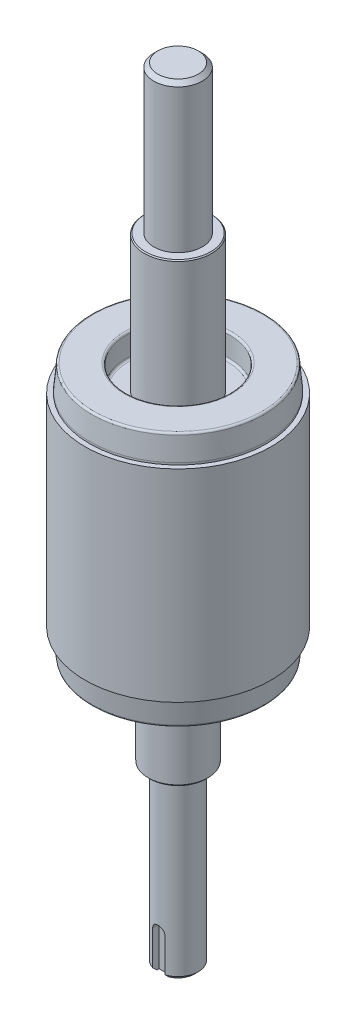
ISO-10303-21;
HEADER;
FILE_DESCRIPTION(('STEP AP214'),'2;1');
FILE_NAME('part.step','',(''),(''),'','','');
FILE_SCHEMA(('AUTOMOTIVE_DESIGN { 1 0 10303 214 1 1 1 1 }'));
ENDSEC;
DATA;
#1=APPLICATION_CONTEXT('core data for automotive mechanical design processes');
#2=APPLICATION_PROTOCOL_DEFINITION('international standard','automotive_design',2000,#1);
#3=PRODUCT_CONTEXT('',#1,'mechanical');
#4=PRODUCT('Part','Part','',(#3));
#5=PRODUCT_RELATED_PRODUCT_CATEGORY('part','',(#4));
#6=PRODUCT_DEFINITION_FORMATION('','',#4);
#7=PRODUCT_DEFINITION_CONTEXT('part definition',#1,'design');
#8=PRODUCT_DEFINITION('design','',#6,#7);
#9=PRODUCT_DEFINITION_SHAPE('','',#8);
#10=(LENGTH_UNIT() NAMED_UNIT(*) SI_UNIT(.MILLI.,.METRE.));
#11=(NAMED_UNIT(*) PLANE_ANGLE_UNIT() SI_UNIT($,.RADIAN.));
#12=(NAMED_UNIT(*) SI_UNIT($,.STERADIAN.) SOLID_ANGLE_UNIT());
#13=UNCERTAINTY_MEASURE_WITH_UNIT(LENGTH_MEASURE(1.E-05),#10,'distance_accuracy_value','');
#14=(GEOMETRIC_REPRESENTATION_CONTEXT(3) GLOBAL_UNCERTAINTY_ASSIGNED_CONTEXT((#13)) GLOBAL_UNIT_ASSIGNED_CONTEXT((#10,
#11,#12)) REPRESENTATION_CONTEXT('',''));
#15=CARTESIAN_POINT('',(0.,0.,0.));
#16=DIRECTION('',(0.,0.,1.));
#17=DIRECTION('',(1.,0.,0.));
#18=AXIS2_PLACEMENT_3D('',#15,#16,#17);
#19=CARTESIAN_POINT('',(0.,-122.8,0.));
#20=DIRECTION('',(0.,-1.,0.));
#21=DIRECTION('',(0.,0.,-1.));
#22=AXIS2_PLACEMENT_3D('',#19,#20,#21);
#23=PLANE('',#22);
#24=CARTESIAN_POINT('',(0.,-122.799999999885,0.));
#25=DIRECTION('',(0.,1.,0.));
#26=DIRECTION('',(0.,0.,1.));
#27=AXIS2_PLACEMENT_3D('',#24,#25,#26);
#28=CIRCLE('',#27,8.06999999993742);
#29=CARTESIAN_POINT('',(0.,-122.799999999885,8.06999999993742));
#30=VERTEX_POINT('',#29);
#31=EDGE_CURVE('E190',#30,#30,#28,.F.);
#32=ORIENTED_EDGE('',*,*,#31,.T.);
#33=EDGE_LOOP('',(#32));
#34=FACE_BOUND('',#33,.T.);
#35=CARTESIAN_POINT('',(0.,-122.8,0.));
#36=DIRECTION('',(0.,-1.,0.));
#37=DIRECTION('',(0.,0.,-1.));
#38=AXIS2_PLACEMENT_3D('',#35,#36,#37);
#39=CIRCLE('',#38,7.4);
#40=CARTESIAN_POINT('',(0.,-122.8,-7.4));
#41=VERTEX_POINT('',#40);
#42=EDGE_CURVE('E177',#41,#41,#39,.T.);
#43=ORIENTED_EDGE('',*,*,#42,.F.);
#44=EDGE_LOOP('',(#43));
#45=FACE_BOUND('',#44,.T.);
#46=ADVANCED_FACE('F34',(#34,#45),#23,.T.);
#47=CARTESIAN_POINT('',(0.,-36.5,0.));
#48=DIRECTION('',(0.,-1.,0.));
#49=DIRECTION('',(0.,0.,-1.));
#50=AXIS2_PLACEMENT_3D('',#47,#48,#49);
#51=PLANE('',#50);
#52=CARTESIAN_POINT('',(0.,-36.5000000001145,0.));
#53=DIRECTION('',(0.,-1.,0.));
#54=DIRECTION('',(1.,0.,0.));
#55=AXIS2_PLACEMENT_3D('',#52,#53,#54);
#56=CIRCLE('',#55,8.06999999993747);
#57=CARTESIAN_POINT('',(8.06999999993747,-36.5000000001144,0.));
#58=VERTEX_POINT('',#57);
#59=EDGE_CURVE('E545',#58,#58,#56,.F.);
#60=ORIENTED_EDGE('',*,*,#59,.T.);
#61=EDGE_LOOP('',(#60));
#62=FACE_BOUND('',#61,.T.);
#63=CARTESIAN_POINT('',(0.,-36.5,0.));
#64=DIRECTION('',(0.,-1.,0.));
#65=DIRECTION('',(0.,0.,-1.));
#66=AXIS2_PLACEMENT_3D('',#63,#64,#65);
#67=CIRCLE('',#66,6.);
#68=CARTESIAN_POINT('',(0.,-36.5,-6.));
#69=VERTEX_POINT('',#68);
#70=EDGE_CURVE('E807',#69,#69,#67,.F.);
#71=ORIENTED_EDGE('',*,*,#70,.F.);
#72=EDGE_LOOP('',(#71));
#73=FACE_BOUND('',#72,.T.);
#74=ADVANCED_FACE('F510',(#62,#73),#51,.F.);
#75=CARTESIAN_POINT('',(0.,-122.8,0.));
#76=DIRECTION('',(0.,1.,0.));
#77=DIRECTION('',(0.,0.,1.));
#78=AXIS2_PLACEMENT_3D('',#75,#76,#77);
#79=CONICAL_SURFACE('',#78,8.06999999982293,0.785398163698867);
#80=CARTESIAN_POINT('',(0.,-122.55,0.));
#81=DIRECTION('',(0.,-1.,0.));
#82=DIRECTION('',(0.47942553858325,0.,-0.877582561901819));
#83=AXIS2_PLACEMENT_3D('',#80,#81,#82);
#84=CIRCLE('',#83,8.31999999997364);
#85=CARTESIAN_POINT('',(3.988820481,-122.55,-7.301486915));
#86=VERTEX_POINT('',#85);
#87=EDGE_CURVE('E524',#86,#86,#84,.T.);
#88=ORIENTED_EDGE('',*,*,#87,.T.);
#89=EDGE_LOOP('',(#88));
#90=FACE_BOUND('',#89,.T.);
#91=ORIENTED_EDGE('',*,*,#31,.F.);
#92=EDGE_LOOP('',(#91));
#93=FACE_BOUND('',#92,.T.);
#94=ADVANCED_FACE('F554',(#90,#93),#79,.T.);
#95=CARTESIAN_POINT('',(0.,-121.3,0.));
#96=DIRECTION('',(0.,-1.,0.));
#97=DIRECTION('',(0.,0.,-1.));
#98=AXIS2_PLACEMENT_3D('',#95,#96,#97);
#99=CYLINDRICAL_SURFACE('',#98,8.31999999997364);
#100=CARTESIAN_POINT('',(0.,-121.3,0.));
#101=DIRECTION('',(0.,-1.,0.));
#102=DIRECTION('',(0.,0.,-1.));
#103=AXIS2_PLACEMENT_3D('',#100,#101,#102);
#104=CIRCLE('',#103,8.31999999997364);
#105=CARTESIAN_POINT('',(0.,-121.3,-8.31999999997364));
#106=VERTEX_POINT('',#105);
#107=EDGE_CURVE('E532',#106,#106,#104,.T.);
#108=ORIENTED_EDGE('',*,*,#107,.T.);
#109=EDGE_LOOP('',(#108));
#110=FACE_BOUND('',#109,.T.);
#111=ORIENTED_EDGE('',*,*,#87,.F.);
#112=EDGE_LOOP('',(#111));
#113=FACE_BOUND('',#112,.T.);
#114=ADVANCED_FACE('F508',(#110,#113),#99,.T.);
#115=CARTESIAN_POINT('',(0.,-121.3,0.));
#116=DIRECTION('',(0.,-1.,0.));
#117=DIRECTION('',(0.,0.,-1.));
#118=AXIS2_PLACEMENT_3D('',#115,#116,#117);
#119=PLANE('',#118);
#120=ORIENTED_EDGE('',*,*,#107,.F.);
#121=EDGE_LOOP('',(#120));
#122=FACE_BOUND('',#121,.T.);
#123=CARTESIAN_POINT('',(0.,-121.3,0.));
#124=DIRECTION('',(0.,1.,0.));
#125=DIRECTION('',(0.479425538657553,0.,-0.877582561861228));
#126=AXIS2_PLACEMENT_3D('',#123,#124,#125);
#127=CIRCLE('',#126,12.3000000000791);
#128=CARTESIAN_POINT('',(-5.89693412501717,-121.3,10.7942655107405));
#129=VERTEX_POINT('',#128);
#130=CARTESIAN_POINT('',(5.89693412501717,-121.3,-10.7942655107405));
#131=VERTEX_POINT('',#130);
#132=EDGE_CURVE('E119',#129,#131,#127,.F.);
#133=ORIENTED_EDGE('',*,*,#132,.T.);
#134=CARTESIAN_POINT('',(0.,-121.3,0.));
#135=DIRECTION('',(0.,1.,0.));
#136=DIRECTION('',(-0.479425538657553,0.,0.877582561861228));
#137=AXIS2_PLACEMENT_3D('',#134,#135,#136);
#138=CIRCLE('',#137,12.2999999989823);
#139=EDGE_CURVE('E492',#131,#129,#138,.F.);
#140=ORIENTED_EDGE('',*,*,#139,.T.);
#141=EDGE_LOOP('',(#133,#140));
#142=FACE_BOUND('',#141,.T.);
#143=ADVANCED_FACE('F499',(#122,#142),#119,.T.);
#144=CARTESIAN_POINT('',(0.,-36.4999999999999,0.));
#145=DIRECTION('',(0.,-1.,0.));
#146=DIRECTION('',(1.,0.,0.));
#147=AXIS2_PLACEMENT_3D('',#144,#145,#146);
#148=CONICAL_SURFACE('',#147,8.06999999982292,0.785398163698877);
#149=ORIENTED_EDGE('',*,*,#59,.F.);
#150=EDGE_LOOP('',(#149));
#151=FACE_BOUND('',#150,.T.);
#152=CARTESIAN_POINT('',(0.,-36.75,0.));
#153=DIRECTION('',(0.,-1.,0.));
#154=DIRECTION('',(-0.47942553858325,0.,0.877582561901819));
#155=AXIS2_PLACEMENT_3D('',#152,#153,#154);
#156=CIRCLE('',#155,8.31999999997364);
#157=CARTESIAN_POINT('',(-3.988820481,-36.75,7.301486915));
#158=VERTEX_POINT('',#157);
#159=EDGE_CURVE('E489',#158,#158,#156,.F.);
#160=ORIENTED_EDGE('',*,*,#159,.T.);
#161=EDGE_LOOP('',(#160));
#162=FACE_BOUND('',#161,.T.);
#163=ADVANCED_FACE('F471',(#151,#162),#148,.T.);
#164=CARTESIAN_POINT('',(5.896934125,-121.3,-10.79426551));
#165=CARTESIAN_POINT('',(6.03735461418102,-121.3,-11.0513034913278));
#166=CARTESIAN_POINT('',(6.13664689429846,-121.507106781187,-11.2330567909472));
#167=CARTESIAN_POINT('',(6.13664689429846,-121.8,-11.2330567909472));
#168=(BOUNDED_CURVE() B_SPLINE_CURVE(3,(#164,#165,#166,#167),.UNSPECIFIED.,.F.,
.F.) B_SPLINE_CURVE_WITH_KNOTS((4,4),(0.,1.),
.UNSPECIFIED.) CURVE() GEOMETRIC_REPRESENTATION_ITEM() RATIONAL_B_SPLINE_CURVE((1.,
0.804737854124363,0.804737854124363,1.)) REPRESENTATION_ITEM(''));
#169=CARTESIAN_POINT('',(0.,-121.8,0.));
#170=DIRECTION('',(0.,-1.,0.));
#171=AXIS1_PLACEMENT('',#169,#170);
#172=SURFACE_OF_REVOLUTION('',#168,#171);
#173=CARTESIAN_POINT('',(0.,-121.8,0.));
#174=DIRECTION('',(0.,-1.,0.));
#175=DIRECTION('',(0.47942553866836,0.,-0.877582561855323));
#176=AXIS2_PLACEMENT_3D('',#173,#174,#175);
#177=CIRCLE('',#176,12.799999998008);
#178=CARTESIAN_POINT('',(6.136646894,-121.8,-11.23305679));
#179=VERTEX_POINT('',#178);
#180=EDGE_CURVE('E482',#179,#179,#177,.T.);
#181=ORIENTED_EDGE('',*,*,#180,.T.);
#182=EDGE_LOOP('',(#181));
#183=FACE_BOUND('',#182,.T.);
#184=ORIENTED_EDGE('',*,*,#139,.F.);
#185=ORIENTED_EDGE('',*,*,#132,.F.);
#186=EDGE_LOOP('',(#184,#185));
#187=FACE_BOUND('',#186,.T.);
#188=ADVANCED_FACE('F459',(#183,#187),#172,.F.);
#189=CARTESIAN_POINT('',(0.,-36.75,0.));
#190=DIRECTION('',(0.,-1.,0.));
#191=DIRECTION('',(0.,0.,-1.));
#192=AXIS2_PLACEMENT_3D('',#189,#190,#191);
#193=CYLINDRICAL_SURFACE('',#192,8.31999999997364);
#194=CARTESIAN_POINT('',(0.,-70.3,0.));
#195=DIRECTION('',(0.,-1.,0.));
#196=DIRECTION('',(0.,0.,-1.));
#197=AXIS2_PLACEMENT_3D('',#194,#195,#196);
#198=CIRCLE('',#197,8.31999999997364);
#199=CARTESIAN_POINT('',(0.,-70.3,-8.31999999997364));
#200=VERTEX_POINT('',#199);
#201=EDGE_CURVE('E488',#200,#200,#198,.F.);
#202=ORIENTED_EDGE('',*,*,#201,.T.);
#203=EDGE_LOOP('',(#202));
#204=FACE_BOUND('',#203,.T.);
#205=ORIENTED_EDGE('',*,*,#159,.F.);
#206=EDGE_LOOP('',(#205));
#207=FACE_BOUND('',#206,.T.);
#208=ADVANCED_FACE('F470',(#204,#207),#193,.T.);
#209=CARTESIAN_POINT('',(0.,-121.8,0.));
#210=DIRECTION('',(0.,-1.,0.));
#211=DIRECTION('',(1.,0.,0.));
#212=AXIS2_PLACEMENT_3D('',#209,#210,#211);
#213=CYLINDRICAL_SURFACE('',#212,12.799999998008);
#214=CARTESIAN_POINT('',(0.,-126.8,0.));
#215=DIRECTION('',(0.,-1.,0.));
#216=DIRECTION('',(0.479425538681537,0.,-0.877582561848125));
#217=AXIS2_PLACEMENT_3D('',#214,#215,#216);
#218=CIRCLE('',#217,12.7999999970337);
#219=CARTESIAN_POINT('',(6.13664689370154,-126.8,-11.2330567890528));
#220=VERTEX_POINT('',#219);
#221=EDGE_CURVE('E481',#220,#220,#218,.T.);
#222=ORIENTED_EDGE('',*,*,#221,.T.);
#223=EDGE_LOOP('',(#222));
#224=FACE_BOUND('',#223,.T.);
#225=ORIENTED_EDGE('',*,*,#180,.F.);
#226=EDGE_LOOP('',(#225));
#227=FACE_BOUND('',#226,.T.);
#228=ADVANCED_FACE('F749',(#224,#227),#213,.F.);
#229=CARTESIAN_POINT('',(0.,-70.3,0.));
#230=DIRECTION('',(0.,-1.,0.));
#231=DIRECTION('',(0.,0.,-1.));
#232=AXIS2_PLACEMENT_3D('',#229,#230,#231);
#233=PLANE('',#232);
#234=ORIENTED_EDGE('',*,*,#201,.F.);
#235=EDGE_LOOP('',(#234));
#236=FACE_BOUND('',#235,.T.);
#237=CARTESIAN_POINT('',(0.,-70.3000000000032,0.));
#238=DIRECTION('',(0.,-1.,0.));
#239=DIRECTION('',(-0.479425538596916,0.,0.877582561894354));
#240=AXIS2_PLACEMENT_3D('',#237,#238,#239);
#241=CIRCLE('',#240,12.3000000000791);
#242=CARTESIAN_POINT('',(5.89693412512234,-70.3000000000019,-10.794265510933));
#243=VERTEX_POINT('',#242);
#244=CARTESIAN_POINT('',(-5.89693412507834,-70.3000000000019,10.794265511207));
#245=VERTEX_POINT('',#244);
#246=EDGE_CURVE('E741',#243,#245,#241,.F.);
#247=ORIENTED_EDGE('',*,*,#246,.T.);
#248=CARTESIAN_POINT('',(0.,-70.3000000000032,0.));
#249=DIRECTION('',(0.,-1.,0.));
#250=DIRECTION('',(0.479425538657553,0.,-0.877582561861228));
#251=AXIS2_PLACEMENT_3D('',#248,#249,#250);
#252=CIRCLE('',#251,12.3000000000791);
#253=EDGE_CURVE('E739',#245,#243,#252,.F.);
#254=ORIENTED_EDGE('',*,*,#253,.T.);
#255=EDGE_LOOP('',(#247,#254));
#256=FACE_BOUND('',#255,.T.);
#257=ADVANCED_FACE('F753',(#236,#256),#233,.F.);
#258=CARTESIAN_POINT('',(6.376359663,-127.3,-11.67184807));
#259=CARTESIAN_POINT('',(6.23593917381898,-127.3,-11.4148100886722));
#260=CARTESIAN_POINT('',(6.13664689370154,-127.092893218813,-11.2330567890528));
#261=CARTESIAN_POINT('',(6.13664689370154,-126.8,-11.2330567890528));
#262=(BOUNDED_CURVE() B_SPLINE_CURVE(3,(#258,#259,#260,#261),.UNSPECIFIED.,.F.,
.F.) B_SPLINE_CURVE_WITH_KNOTS((4,4),(0.,1.),
.UNSPECIFIED.) CURVE() GEOMETRIC_REPRESENTATION_ITEM() RATIONAL_B_SPLINE_CURVE((1.,
0.804737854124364,0.804737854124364,1.)) REPRESENTATION_ITEM(''));
#263=CARTESIAN_POINT('',(0.,-126.8,0.));
#264=DIRECTION('',(0.,-1.,0.));
#265=AXIS1_PLACEMENT('',#263,#264);
#266=SURFACE_OF_REVOLUTION('',#262,#265);
#267=CARTESIAN_POINT('',(0.,-127.3,0.));
#268=DIRECTION('',(0.,-1.,0.));
#269=DIRECTION('',(0.479425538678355,0.,-0.877582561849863));
#270=AXIS2_PLACEMENT_3D('',#267,#268,#269);
#271=CIRCLE('',#270,13.2999999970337);
#272=CARTESIAN_POINT('',(6.37635966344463,-127.3,-11.6718480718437));
#273=VERTEX_POINT('',#272);
#274=CARTESIAN_POINT('',(-6.376359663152,-127.3,11.671848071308));
#275=VERTEX_POINT('',#274);
#276=EDGE_CURVE('E727',#273,#275,#271,.T.);
#277=ORIENTED_EDGE('',*,*,#276,.T.);
#278=CARTESIAN_POINT('',(0.,-127.3,0.));
#279=DIRECTION('',(0.,-1.,0.));
#280=DIRECTION('',(-0.479425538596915,0.,0.877582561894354));
#281=AXIS2_PLACEMENT_3D('',#278,#279,#280);
#282=CIRCLE('',#281,13.2999999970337);
#283=EDGE_CURVE('E444',#275,#273,#282,.T.);
#284=ORIENTED_EDGE('',*,*,#283,.T.);
#285=EDGE_LOOP('',(#277,#284));
#286=FACE_BOUND('',#285,.T.);
#287=ORIENTED_EDGE('',*,*,#221,.F.);
#288=EDGE_LOOP('',(#287));
#289=FACE_BOUND('',#288,.T.);
#290=ADVANCED_FACE('F418',(#286,#289),#266,.T.);
#291=CARTESIAN_POINT('',(6.1366468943,-69.8,-11.23305679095));
#292=CARTESIAN_POINT('',(6.1366468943,-70.0928932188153,-11.23305679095));
#293=CARTESIAN_POINT('',(6.03735461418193,-70.3000000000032,-11.0513034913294));
#294=CARTESIAN_POINT('',(5.896934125,-70.3000000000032,-10.79426551));
#295=(BOUNDED_CURVE() B_SPLINE_CURVE(3,(#291,#292,#293,#294),.UNSPECIFIED.,.F.,
.F.) B_SPLINE_CURVE_WITH_KNOTS((4,4),(0.,1.),
.UNSPECIFIED.) CURVE() GEOMETRIC_REPRESENTATION_ITEM() RATIONAL_B_SPLINE_CURVE((1.,
0.804737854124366,0.804737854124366,1.)) REPRESENTATION_ITEM(''));
#296=CARTESIAN_POINT('',(0.,-69.8,0.));
#297=DIRECTION('',(0.,-1.,0.));
#298=AXIS1_PLACEMENT('',#296,#297);
#299=SURFACE_OF_REVOLUTION('',#295,#298);
#300=ORIENTED_EDGE('',*,*,#253,.F.);
#301=ORIENTED_EDGE('',*,*,#246,.F.);
#302=EDGE_LOOP('',(#300,#301));
#303=FACE_BOUND('',#302,.T.);
#304=CARTESIAN_POINT('',(0.,-69.8,0.));
#305=DIRECTION('',(0.,-1.,0.));
#306=DIRECTION('',(0.47942553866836,0.,-0.877582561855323));
#307=AXIS2_PLACEMENT_3D('',#304,#305,#306);
#308=CIRCLE('',#307,12.799999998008);
#309=CARTESIAN_POINT('',(6.136646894,-69.8,-11.23305679));
#310=VERTEX_POINT('',#309);
#311=EDGE_CURVE('E406',#310,#310,#308,.F.);
#312=ORIENTED_EDGE('',*,*,#311,.T.);
#313=EDGE_LOOP('',(#312));
#314=FACE_BOUND('',#313,.T.);
#315=ADVANCED_FACE('F412',(#303,#314),#299,.F.);
#316=CARTESIAN_POINT('',(0.,-127.3,0.));
#317=DIRECTION('',(0.,-1.,0.));
#318=DIRECTION('',(0.,0.,-1.));
#319=AXIS2_PLACEMENT_3D('',#316,#317,#318);
#320=PLANE('',#319);
#321=ORIENTED_EDGE('',*,*,#283,.F.);
#322=ORIENTED_EDGE('',*,*,#276,.F.);
#323=EDGE_LOOP('',(#321,#322));
#324=FACE_BOUND('',#323,.T.);
#325=CARTESIAN_POINT('',(0.,-127.300000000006,0.));
#326=DIRECTION('',(0.,1.,0.));
#327=DIRECTION('',(-0.479424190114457,0.,0.877583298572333));
#328=AXIS2_PLACEMENT_3D('',#325,#326,#327);
#329=CIRCLE('',#328,20.8169024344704);
#330=CARTESIAN_POINT('',(16.110202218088,-127.300000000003,13.1835052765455));
#331=VERTEX_POINT('',#330);
#332=CARTESIAN_POINT('',(-9.98014062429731,-127.300000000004,18.2685582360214));
#333=VERTEX_POINT('',#332);
#334=EDGE_CURVE('E697',#331,#333,#329,.F.);
#335=ORIENTED_EDGE('',*,*,#334,.T.);
#336=CARTESIAN_POINT('',(0.,-127.300000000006,0.));
#337=DIRECTION('',(0.,1.,0.));
#338=DIRECTION('',(0.479425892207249,0.,-0.877582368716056));
#339=AXIS2_PLACEMENT_3D('',#336,#337,#338);
#340=CIRCLE('',#339,20.8169024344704);
#341=CARTESIAN_POINT('',(9.98015834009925,-127.300000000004,-18.2685485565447));
#342=VERTEX_POINT('',#341);
#343=EDGE_CURVE('E392',#333,#342,#340,.F.);
#344=ORIENTED_EDGE('',*,*,#343,.T.);
#345=CARTESIAN_POINT('',(0.,-127.300000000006,0.));
#346=DIRECTION('',(0.,1.,0.));
#347=DIRECTION('',(0.773900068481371,0.,0.633307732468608));
#348=AXIS2_PLACEMENT_3D('',#345,#346,#347);
#349=CIRCLE('',#348,20.8169024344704);
#350=EDGE_CURVE('E707',#342,#331,#349,.F.);
#351=ORIENTED_EDGE('',*,*,#350,.T.);
#352=EDGE_LOOP('',(#335,#344,#351));
#353=FACE_BOUND('',#352,.T.);
#354=ADVANCED_FACE('F417',(#324,#353),#320,.T.);
#355=CARTESIAN_POINT('',(0.,-64.8,0.));
#356=DIRECTION('',(0.,-1.,0.));
#357=DIRECTION('',(0.,0.,-1.));
#358=AXIS2_PLACEMENT_3D('',#355,#356,#357);
#359=CYLINDRICAL_SURFACE('',#358,12.799999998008);
#360=CARTESIAN_POINT('',(0.,-64.8,0.));
#361=DIRECTION('',(0.,-1.,0.));
#362=DIRECTION('',(0.479425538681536,0.,-0.877582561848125));
#363=AXIS2_PLACEMENT_3D('',#360,#361,#362);
#364=CIRCLE('',#363,12.7999999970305);
#365=CARTESIAN_POINT('',(-6.136646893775,-64.8,11.2330567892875));
#366=VERTEX_POINT('',#365);
#367=CARTESIAN_POINT('',(6.136646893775,-64.8,-11.2330567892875));
#368=VERTEX_POINT('',#367);
#369=EDGE_CURVE('E327',#366,#368,#364,.F.);
#370=ORIENTED_EDGE('',*,*,#369,.T.);
#371=CARTESIAN_POINT('',(0.,-64.8,0.));
#372=DIRECTION('',(0.,-1.,0.));
#373=DIRECTION('',(-0.479425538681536,0.,0.877582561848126));
#374=AXIS2_PLACEMENT_3D('',#371,#372,#373);
#375=CIRCLE('',#374,12.7999999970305);
#376=EDGE_CURVE('E333',#368,#366,#375,.F.);
#377=ORIENTED_EDGE('',*,*,#376,.T.);
#378=EDGE_LOOP('',(#370,#377));
#379=FACE_BOUND('',#378,.T.);
#380=ORIENTED_EDGE('',*,*,#311,.F.);
#381=EDGE_LOOP('',(#380));
#382=FACE_BOUND('',#381,.T.);
#383=ADVANCED_FACE('F907',(#379,#382),#359,.F.);
#384=CARTESIAN_POINT('',(-10.218955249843,-126.843577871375,18.7056721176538));
#385=CARTESIAN_POINT('',(-10.2075474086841,-127.115553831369,18.6847902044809));
#386=CARTESIAN_POINT('',(-10.111044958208,-127.300000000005,18.5081436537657));
#387=CARTESIAN_POINT('',(-9.98015466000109,-127.300000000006,18.268550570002));
#388=(BOUNDED_CURVE() B_SPLINE_CURVE(3,(#384,#385,#386,#387),.UNSPECIFIED.,.F.,
.F.) B_SPLINE_CURVE_WITH_KNOTS((4,4),(0.,1.),
.UNSPECIFIED.) CURVE() GEOMETRIC_REPRESENTATION_ITEM() RATIONAL_B_SPLINE_CURVE((1.,
0.824851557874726,0.824851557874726,1.)) REPRESENTATION_ITEM(''));
#389=CARTESIAN_POINT('',(0.,-126.8,0.));
#390=DIRECTION('',(0.,-1.,0.));
#391=AXIS1_PLACEMENT('',#389,#390);
#392=SURFACE_OF_REVOLUTION('',#388,#391);
#393=CARTESIAN_POINT('',(0.,-126.843577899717,0.));
#394=DIRECTION('',(0.,-1.,0.));
#395=DIRECTION('',(-0.479425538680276,0.,0.877582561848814));
#396=AXIS2_PLACEMENT_3D('',#393,#394,#395);
#397=CIRCLE('',#396,21.3149997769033);
#398=CARTESIAN_POINT('',(-10.2189552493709,-126.843577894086,18.705672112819));
#399=VERTEX_POINT('',#398);
#400=CARTESIAN_POINT('',(10.2189552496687,-126.843577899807,-18.7056721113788));
#401=VERTEX_POINT('',#400);
#402=EDGE_CURVE('E326',#399,#401,#397,.T.);
#403=ORIENTED_EDGE('',*,*,#402,.T.);
#404=CARTESIAN_POINT('',(9.98015466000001,-126.8,-18.26855057));
#405=DIRECTION('',(-0.877582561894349,0.,-0.479425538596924));
#406=DIRECTION('',(-0.479425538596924,0.,0.877582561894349));
#407=AXIS2_PLACEMENT_3D('',#404,#405,#406);
#408=CIRCLE('',#407,0.500000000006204);
#409=EDGE_CURVE('E667',#401,#342,#408,.T.);
#410=ORIENTED_EDGE('',*,*,#409,.T.);
#411=ORIENTED_EDGE('',*,*,#343,.F.);
#412=CARTESIAN_POINT('',(-9.98015466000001,-126.8,18.26855057));
#413=DIRECTION('',(-0.877582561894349,0.,-0.479425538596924));
#414=DIRECTION('',(-0.479425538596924,0.,0.877582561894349));
#415=AXIS2_PLACEMENT_3D('',#412,#413,#414);
#416=CIRCLE('',#415,0.500000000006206);
#417=EDGE_CURVE('E358',#333,#399,#416,.T.);
#418=ORIENTED_EDGE('',*,*,#417,.T.);
#419=EDGE_LOOP('',(#403,#410,#411,#418));
#420=FACE_BOUND('',#419,.T.);
#421=ADVANCED_FACE('F367',(#420),#392,.T.);
#422=CARTESIAN_POINT('',(10.218955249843,-126.843577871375,-18.7056721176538));
#423=CARTESIAN_POINT('',(10.2075474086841,-127.115553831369,-18.6847902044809));
#424=CARTESIAN_POINT('',(10.111044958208,-127.300000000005,-18.5081436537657));
#425=CARTESIAN_POINT('',(9.98015466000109,-127.300000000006,-18.268550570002));
#426=(BOUNDED_CURVE() B_SPLINE_CURVE(3,(#422,#423,#424,#425),.UNSPECIFIED.,.F.,
.F.) B_SPLINE_CURVE_WITH_KNOTS((4,4),(0.,1.),
.UNSPECIFIED.) CURVE() GEOMETRIC_REPRESENTATION_ITEM() RATIONAL_B_SPLINE_CURVE((1.,
0.824851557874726,0.824851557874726,1.)) REPRESENTATION_ITEM(''));
#427=CARTESIAN_POINT('',(0.,-126.8,0.));
#428=DIRECTION('',(0.,-1.,0.));
#429=AXIS1_PLACEMENT('',#427,#428);
#430=SURFACE_OF_REVOLUTION('',#426,#429);
#431=CARTESIAN_POINT('',(0.,-126.843577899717,0.));
#432=DIRECTION('',(0.,-1.,0.));
#433=DIRECTION('',(0.479425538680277,0.,-0.877582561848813));
#434=AXIS2_PLACEMENT_3D('',#431,#432,#433);
#435=CIRCLE('',#434,21.3149997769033);
#436=EDGE_CURVE('E658',#401,#399,#435,.T.);
#437=ORIENTED_EDGE('',*,*,#436,.T.);
#438=ORIENTED_EDGE('',*,*,#417,.F.);
#439=ORIENTED_EDGE('',*,*,#334,.F.);
#440=ORIENTED_EDGE('',*,*,#350,.F.);
#441=ORIENTED_EDGE('',*,*,#409,.F.);
#442=EDGE_LOOP('',(#437,#438,#439,#440,#441));
#443=FACE_BOUND('',#442,.T.);
#444=ADVANCED_FACE('F363',(#443),#430,.T.);
#445=CARTESIAN_POINT('',(-6.1366468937,-64.8,11.23305678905));
#446=CARTESIAN_POINT('',(-6.1366468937,-64.5071067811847,11.23305678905));
#447=CARTESIAN_POINT('',(-6.23593917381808,-64.2999999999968,11.4148100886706));
#448=CARTESIAN_POINT('',(-6.37635966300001,-64.2999999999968,11.67184807));
#449=(BOUNDED_CURVE() B_SPLINE_CURVE(3,(#445,#446,#447,#448),.UNSPECIFIED.,.F.,
.F.) B_SPLINE_CURVE_WITH_KNOTS((4,4),(0.,1.),
.UNSPECIFIED.) CURVE() GEOMETRIC_REPRESENTATION_ITEM() RATIONAL_B_SPLINE_CURVE((1.,
0.804737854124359,0.804737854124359,1.)) REPRESENTATION_ITEM(''));
#450=CARTESIAN_POINT('',(0.,-64.8,0.));
#451=DIRECTION('',(0.,-1.,0.));
#452=AXIS1_PLACEMENT('',#450,#451);
#453=SURFACE_OF_REVOLUTION('',#449,#452);
#454=ORIENTED_EDGE('',*,*,#376,.F.);
#455=CARTESIAN_POINT('',(6.376359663,-64.8,-11.67184807));
#456=DIRECTION('',(-0.877582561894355,0.,-0.479425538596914));
#457=DIRECTION('',(-0.479425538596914,0.,0.877582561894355));
#458=AXIS2_PLACEMENT_3D('',#455,#456,#457);
#459=CIRCLE('',#458,0.500000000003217);
#460=CARTESIAN_POINT('',(6.376359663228,-64.2999999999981,-11.671848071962));
#461=VERTEX_POINT('',#460);
#462=EDGE_CURVE('E318',#368,#461,#459,.T.);
#463=ORIENTED_EDGE('',*,*,#462,.T.);
#464=CARTESIAN_POINT('',(0.,-64.2999999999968,0.));
#465=DIRECTION('',(0.,1.,0.));
#466=DIRECTION('',(0.479425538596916,0.,-0.877582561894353));
#467=AXIS2_PLACEMENT_3D('',#464,#465,#466);
#468=CIRCLE('',#467,13.2999999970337);
#469=CARTESIAN_POINT('',(-6.376359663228,-64.2999999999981,11.671848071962));
#470=VERTEX_POINT('',#469);
#471=EDGE_CURVE('E345',#461,#470,#468,.T.);
#472=ORIENTED_EDGE('',*,*,#471,.T.);
#473=CARTESIAN_POINT('',(-6.376359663,-64.8,11.67184807));
#474=DIRECTION('',(-0.877582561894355,0.,-0.479425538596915));
#475=DIRECTION('',(-0.479425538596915,0.,0.877582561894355));
#476=AXIS2_PLACEMENT_3D('',#473,#474,#475);
#477=CIRCLE('',#476,0.500000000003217);
#478=EDGE_CURVE('E330',#470,#366,#477,.T.);
#479=ORIENTED_EDGE('',*,*,#478,.T.);
#480=EDGE_LOOP('',(#454,#463,#472,#479));
#481=FACE_BOUND('',#480,.T.);
#482=ADVANCED_FACE('F309',(#481),#453,.T.);
#483=CARTESIAN_POINT('',(6.1366468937,-64.8,-11.23305678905));
#484=CARTESIAN_POINT('',(6.1366468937,-64.5071067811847,-11.23305678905));
#485=CARTESIAN_POINT('',(6.23593917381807,-64.2999999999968,-11.4148100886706));
#486=CARTESIAN_POINT('',(6.376359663,-64.2999999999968,-11.67184807));
#487=(BOUNDED_CURVE() B_SPLINE_CURVE(3,(#483,#484,#485,#486),.UNSPECIFIED.,.F.,
.F.) B_SPLINE_CURVE_WITH_KNOTS((4,4),(0.,1.),
.UNSPECIFIED.) CURVE() GEOMETRIC_REPRESENTATION_ITEM() RATIONAL_B_SPLINE_CURVE((1.,
0.804737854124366,0.804737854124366,1.)) REPRESENTATION_ITEM(''));
#488=CARTESIAN_POINT('',(0.,-64.8,0.));
#489=DIRECTION('',(0.,-1.,0.));
#490=AXIS1_PLACEMENT('',#488,#489);
#491=SURFACE_OF_REVOLUTION('',#487,#490);
#492=ORIENTED_EDGE('',*,*,#369,.F.);
#493=ORIENTED_EDGE('',*,*,#478,.F.);
#494=CARTESIAN_POINT('',(0.,-64.2999999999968,0.));
#495=DIRECTION('',(0.,1.,0.));
#496=DIRECTION('',(-0.479425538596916,0.,0.877582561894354));
#497=AXIS2_PLACEMENT_3D('',#494,#495,#496);
#498=CIRCLE('',#497,13.2999999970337);
#499=EDGE_CURVE('E292',#470,#461,#498,.T.);
#500=ORIENTED_EDGE('',*,*,#499,.T.);
#501=ORIENTED_EDGE('',*,*,#462,.F.);
#502=EDGE_LOOP('',(#492,#493,#500,#501));
#503=FACE_BOUND('',#502,.T.);
#504=ADVANCED_FACE('F303',(#503),#491,.T.);
#505=CARTESIAN_POINT('',(0.,-126.8435779,0.));
#506=DIRECTION('',(0.,1.,0.));
#507=DIRECTION('',(0.,0.,1.));
#508=AXIS2_PLACEMENT_3D('',#505,#506,#507);
#509=CONICAL_SURFACE('',#508,21.3149997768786,0.087266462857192);
#510=CARTESIAN_POINT('',(0.,-121.3,0.));
#511=DIRECTION('',(0.,-1.,0.));
#512=DIRECTION('',(0.479425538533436,0.,-0.877582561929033));
#513=AXIS2_PLACEMENT_3D('',#510,#511,#512);
#514=CIRCLE('',#513,21.7999999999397);
#515=CARTESIAN_POINT('',(10.45147674,-121.3,-19.13129985));
#516=VERTEX_POINT('',#515);
#517=EDGE_CURVE('E284',#516,#516,#514,.T.);
#518=ORIENTED_EDGE('',*,*,#517,.T.);
#519=EDGE_LOOP('',(#518));
#520=FACE_BOUND('',#519,.T.);
#521=ORIENTED_EDGE('',*,*,#436,.F.);
#522=ORIENTED_EDGE('',*,*,#402,.F.);
#523=EDGE_LOOP('',(#521,#522));
#524=FACE_BOUND('',#523,.T.);
#525=ADVANCED_FACE('F308',(#520,#524),#509,.T.);
#526=CARTESIAN_POINT('',(0.,-64.3,0.));
#527=DIRECTION('',(0.,-1.,0.));
#528=DIRECTION('',(0.,0.,-1.));
#529=AXIS2_PLACEMENT_3D('',#526,#527,#528);
#530=PLANE('',#529);
#531=ORIENTED_EDGE('',*,*,#471,.F.);
#532=ORIENTED_EDGE('',*,*,#499,.F.);
#533=EDGE_LOOP('',(#531,#532));
#534=FACE_BOUND('',#533,.T.);
#535=CARTESIAN_POINT('',(0.,-64.3,0.));
#536=DIRECTION('',(0.,-1.,0.));
#537=DIRECTION('',(0.843090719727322,0.,0.537771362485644));
#538=AXIS2_PLACEMENT_3D('',#535,#536,#537);
#539=CIRCLE('',#538,20.8169024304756);
#540=CARTESIAN_POINT('',(-9.98014640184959,-64.3,18.2685550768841));
#541=VERTEX_POINT('',#540);
#542=CARTESIAN_POINT('',(17.550537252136,-64.3,11.1947339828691));
#543=VERTEX_POINT('',#542);
#544=EDGE_CURVE('E279',#541,#543,#539,.F.);
#545=ORIENTED_EDGE('',*,*,#544,.T.);
#546=CARTESIAN_POINT('',(0.,-64.3,0.));
#547=DIRECTION('',(0.,-1.,0.));
#548=DIRECTION('',(0.479426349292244,0.,-0.877582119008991));
#549=AXIS2_PLACEMENT_3D('',#546,#547,#548);
#550=CIRCLE('',#549,20.8169024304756);
#551=CARTESIAN_POINT('',(9.98015626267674,-64.3,-18.2685496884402));
#552=VERTEX_POINT('',#551);
#553=EDGE_CURVE('E268',#543,#552,#550,.F.);
#554=ORIENTED_EDGE('',*,*,#553,.T.);
#555=CARTESIAN_POINT('',(0.,-64.3,0.));
#556=DIRECTION('',(0.,-1.,0.));
#557=DIRECTION('',(-0.479425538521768,0.,0.877582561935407));
#558=AXIS2_PLACEMENT_3D('',#555,#556,#557);
#559=CIRCLE('',#558,20.8169024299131);
#560=EDGE_CURVE('E1250',#552,#541,#559,.F.);
#561=ORIENTED_EDGE('',*,*,#560,.T.);
#562=EDGE_LOOP('',(#545,#554,#561));
#563=FACE_BOUND('',#562,.T.);
#564=ADVANCED_FACE('F651',(#534,#563),#530,.F.);
#565=CARTESIAN_POINT('',(0.,-120.8,0.));
#566=DIRECTION('',(0.,-1.,0.));
#567=DIRECTION('',(1.,0.,0.));
#568=AXIS2_PLACEMENT_3D('',#565,#566,#567);
#569=CYLINDRICAL_SURFACE('',#568,21.7999999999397);
#570=CARTESIAN_POINT('',(0.,-120.8,0.));
#571=DIRECTION('',(0.,-1.,0.));
#572=DIRECTION('',(1.,0.,0.));
#573=AXIS2_PLACEMENT_3D('',#570,#571,#572);
#574=CIRCLE('',#573,21.7999999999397);
#575=CARTESIAN_POINT('',(21.7999999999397,-120.8,0.));
#576=VERTEX_POINT('',#575);
#577=EDGE_CURVE('E198',#576,#576,#574,.T.);
#578=ORIENTED_EDGE('',*,*,#577,.T.);
#579=EDGE_LOOP('',(#578));
#580=FACE_BOUND('',#579,.T.);
#581=ORIENTED_EDGE('',*,*,#517,.F.);
#582=EDGE_LOOP('',(#581));
#583=FACE_BOUND('',#582,.T.);
#584=ADVANCED_FACE('F648',(#580,#583),#569,.T.);
#585=CARTESIAN_POINT('',(9.97690204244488,-64.3,-18.2626291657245));
#586=CARTESIAN_POINT('',(9.97798169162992,-64.3,-18.2646054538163));
#587=CARTESIAN_POINT('',(9.97906134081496,-64.3,-18.2665817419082));
#588=CARTESIAN_POINT('',(9.98014099,-64.3,-18.26855803));
#589=CARTESIAN_POINT('',(10.1110311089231,-64.3,-18.5081512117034));
#590=CARTESIAN_POINT('',(10.2075334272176,-64.4844461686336,-18.6847978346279));
#591=CARTESIAN_POINT('',(10.2189412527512,-64.7564221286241,-18.7056797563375));
#592=(BOUNDED_CURVE() B_SPLINE_CURVE(3,(#585,#586,#587,#588,#589,#590,#591),.UNSPECIFIED.,.F.,
.F.) B_SPLINE_CURVE_WITH_KNOTS((4,3,4),(-0.01,0.,1.),
.UNSPECIFIED.) CURVE() GEOMETRIC_REPRESENTATION_ITEM() RATIONAL_B_SPLINE_CURVE((1.,1.,1.,1.,
0.82485155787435,0.82485155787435,1.)) REPRESENTATION_ITEM(''));
#593=CARTESIAN_POINT('',(0.,-64.8,0.));
#594=DIRECTION('',(0.,-1.,0.));
#595=AXIS1_PLACEMENT('',#593,#594);
#596=SURFACE_OF_REVOLUTION('',#592,#595);
#597=ORIENTED_EDGE('',*,*,#553,.F.);
#598=ORIENTED_EDGE('',*,*,#544,.F.);
#599=CARTESIAN_POINT('',(-9.98013814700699,-64.3,18.2685595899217));
#600=CARTESIAN_POINT('',(-9.98353946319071,-64.2999999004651,18.274785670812));
#601=CARTESIAN_POINT('',(-9.98694078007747,-64.3001509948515,18.2810117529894));
#602=CARTESIAN_POINT('',(-9.99379081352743,-64.3007596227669,18.2935506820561));
#603=CARTESIAN_POINT('',(-9.99723943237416,-64.3012219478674,18.2998633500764));
#604=CARTESIAN_POINT('',(-10.0041752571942,-64.3024663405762,18.3125593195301));
#605=CARTESIAN_POINT('',(-10.0076622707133,-64.3032530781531,18.3189422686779));
#606=CARTESIAN_POINT('',(-10.0146652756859,-64.3051581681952,18.3317612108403));
#607=CARTESIAN_POINT('',(-10.0181809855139,-64.3062810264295,18.3381966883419));
#608=CARTESIAN_POINT('',(-10.0252310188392,-64.3088687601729,18.3511017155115));
#609=CARTESIAN_POINT('',(-10.0287649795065,-64.3103379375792,18.3575706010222));
#610=CARTESIAN_POINT('',(-10.035840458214,-64.3136269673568,18.3705222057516));
#611=CARTESIAN_POINT('',(-10.0393815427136,-64.3154508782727,18.3770041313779));
#612=CARTESIAN_POINT('',(-10.0464595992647,-64.3194560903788,18.3899604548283));
#613=CARTESIAN_POINT('',(-10.0499960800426,-64.3216411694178,18.3964339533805));
#614=CARTESIAN_POINT('',(-10.057052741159,-64.3263732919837,18.4093511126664));
#615=CARTESIAN_POINT('',(-10.0605723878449,-64.3289237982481,18.4157937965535));
#616=CARTESIAN_POINT('',(-10.0675827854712,-64.3343890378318,18.4286262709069));
#617=CARTESIAN_POINT('',(-10.0710729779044,-64.3373068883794,18.4350150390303));
#618=CARTESIAN_POINT('',(-10.0780115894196,-64.3435066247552,18.4477161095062));
#619=CARTESIAN_POINT('',(-10.0814594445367,-64.3467912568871,18.4540273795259));
#620=CARTESIAN_POINT('',(-10.0883003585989,-64.3537218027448,18.4665496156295));
#621=CARTESIAN_POINT('',(-10.0916928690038,-64.3573700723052,18.4727595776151));
#622=CARTESIAN_POINT('',(-10.0984100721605,-64.3650225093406,18.4850553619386));
#623=CARTESIAN_POINT('',(-10.1017342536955,-64.369028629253,18.4911402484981));
#624=CARTESIAN_POINT('',(-10.1083019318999,-64.3773887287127,18.5031623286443));
#625=CARTESIAN_POINT('',(-10.1115449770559,-64.381744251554,18.5090986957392));
#626=CARTESIAN_POINT('',(-10.1179378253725,-64.3907924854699,18.5208007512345));
#627=CARTESIAN_POINT('',(-10.121087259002,-64.3954863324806,18.5265657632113));
#628=CARTESIAN_POINT('',(-10.1272807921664,-64.405197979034,18.5379029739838));
#629=CARTESIAN_POINT('',(-10.1303246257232,-64.4102165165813,18.5434746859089));
#630=CARTESIAN_POINT('',(-10.1362954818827,-64.4205618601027,18.5544042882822));
#631=CARTESIAN_POINT('',(-10.1392223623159,-64.4258890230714,18.5597619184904));
#632=CARTESIAN_POINT('',(-10.1449485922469,-64.4368336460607,18.570243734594));
#633=CARTESIAN_POINT('',(-10.1477479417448,-64.4424511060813,18.5753679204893));
#634=CARTESIAN_POINT('',(-10.1532092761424,-64.4539562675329,18.5853648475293));
#635=CARTESIAN_POINT('',(-10.1558714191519,-64.4598436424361,18.5902378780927));
#636=CARTESIAN_POINT('',(-10.1610495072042,-64.4718667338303,18.5997163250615));
#637=CARTESIAN_POINT('',(-10.1635657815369,-64.478001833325,18.6043223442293));
#638=CARTESIAN_POINT('',(-10.16844439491,-64.4904969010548,18.6132526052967));
#639=CARTESIAN_POINT('',(-10.1708072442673,-64.4968560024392,18.6175777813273));
#640=CARTESIAN_POINT('',(-10.1753724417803,-64.5097743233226,18.6259343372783));
#641=CARTESIAN_POINT('',(-10.1775754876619,-64.5163324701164,18.6299669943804));
#642=CARTESIAN_POINT('',(-10.1818157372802,-64.529623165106,18.6377287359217));
#643=CARTESIAN_POINT('',(-10.1838538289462,-64.53635448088,18.6414594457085));
#644=CARTESIAN_POINT('',(-10.1877600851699,-64.5499651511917,18.6486098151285));
#645=CARTESIAN_POINT('',(-10.1896293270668,-64.5568431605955,18.6520314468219));
#646=CARTESIAN_POINT('',(-10.1931950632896,-64.5707205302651,18.6585584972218));
#647=CARTESIAN_POINT('',(-10.1948928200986,-64.5777184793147,18.6616662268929));
#648=CARTESIAN_POINT('',(-10.1981140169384,-64.5918090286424,18.6675626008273));
#649=CARTESIAN_POINT('',(-10.1996388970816,-64.5989001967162,18.6703538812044));
#650=CARTESIAN_POINT('',(-10.202513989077,-64.6131507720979,18.6756167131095));
#651=CARTESIAN_POINT('',(-10.2038658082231,-64.6203087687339,18.6780912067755));
#652=CARTESIAN_POINT('',(-10.2063955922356,-64.6346671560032,18.6827219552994));
#653=CARTESIAN_POINT('',(-10.2075753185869,-64.6418661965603,18.6848814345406));
#654=CARTESIAN_POINT('',(-10.209762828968,-64.656281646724,18.6888856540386));
#655=CARTESIAN_POINT('',(-10.210772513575,-64.663496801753,18.6907338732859));
#656=CARTESIAN_POINT('',(-10.2126228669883,-64.6779205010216,18.6941209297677));
#657=CARTESIAN_POINT('',(-10.2134655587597,-64.6851279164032,18.6956634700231));
#658=CARTESIAN_POINT('',(-10.2149857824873,-64.6995133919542,18.6984462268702));
#659=CARTESIAN_POINT('',(-10.2156654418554,-64.7066904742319,18.6996903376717));
#660=CARTESIAN_POINT('',(-10.2168642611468,-64.7209939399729,18.7018847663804));
#661=CARTESIAN_POINT('',(-10.2173856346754,-64.7281195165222,18.7028391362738));
#662=CARTESIAN_POINT('',(-10.2182733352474,-64.7423001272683,18.704464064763));
#663=CARTESIAN_POINT('',(-10.2186419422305,-64.7493545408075,18.7051387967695));
#664=CARTESIAN_POINT('',(-10.2189383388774,-64.756422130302,18.7056813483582));
#665=B_SPLINE_CURVE_WITH_KNOTS('',3,(#599,#600,#601,#602,#603,#604,#605,#606,#607,#608,#609,
#610,#611,#612,#613,#614,#615,#616,#617,#618,#619,#620,#621,#622,#623,#624,#625,#626,#627,#628,
#629,#630,#631,#632,#633,#634,#635,#636,#637,#638,#639,#640,#641,#642,#643,#644,#645,#646,#647,
#648,#649,#650,#651,#652,#653,#654,#655,#656,#657,#658,#659,#660,#661,#662,#663,#664),
.UNSPECIFIED.,.F.,.F.,(4,2,2,2,2,2,2,2,2,2,2,2,2,2,2,2,2,2,2,2,2,2,2,2,2,2,2,2,2,2,2,2,4),(0.,
0.0212821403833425,0.0428996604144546,0.0648398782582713,0.0870884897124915,0.109629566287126,
0.132445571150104,0.155517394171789,0.178824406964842,0.20234453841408,0.226054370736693,
0.249929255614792,0.273943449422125,0.298070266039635,0.322282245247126,0.346551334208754,
0.370849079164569,0.395146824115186,0.419415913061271,0.443627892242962,0.467754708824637,
0.491768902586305,0.515643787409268,0.539353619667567,0.562873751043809,0.58618076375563,
0.609252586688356,0.63206859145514,0.654609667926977,0.676858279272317,0.698798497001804,
0.720416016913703,0.741698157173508),.UNSPECIFIED.);
#666=CARTESIAN_POINT('',(-10.21894679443,-64.7564221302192,18.7056767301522));
#667=VERTEX_POINT('',#666);
#668=EDGE_CURVE('E542',#541,#667,#665,.T.);
#669=ORIENTED_EDGE('',*,*,#668,.T.);
#670=CARTESIAN_POINT('',(0.,-64.7564221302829,0.));
#671=DIRECTION('',(0.,-1.,0.));
#672=DIRECTION('',(0.479425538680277,0.,-0.877582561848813));
#673=AXIS2_PLACEMENT_3D('',#670,#671,#672);
#674=CIRCLE('',#673,21.3149997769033);
#675=CARTESIAN_POINT('',(10.2189577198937,-64.7564221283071,-18.7056707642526));
#676=VERTEX_POINT('',#675);
#677=EDGE_CURVE('E57',#667,#676,#674,.F.);
#678=ORIENTED_EDGE('',*,*,#677,.T.);
#679=CARTESIAN_POINT('',(10.2189412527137,-64.7564221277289,-18.7056797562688));
#680=CARTESIAN_POINT('',(10.2186448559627,-64.7493545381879,-18.7051372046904));
#681=CARTESIAN_POINT('',(10.2182762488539,-64.742300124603,-18.7044624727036));
#682=CARTESIAN_POINT('',(10.2173885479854,-64.7281195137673,-18.7028375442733));
#683=CARTESIAN_POINT('',(10.2168671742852,-64.7209939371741,-18.7018831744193));
#684=CARTESIAN_POINT('',(10.2156683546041,-64.7066904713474,-18.6996887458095));
#685=CARTESIAN_POINT('',(10.2149886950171,-64.699513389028,-18.6984446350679));
#686=CARTESIAN_POINT('',(10.2134684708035,-64.6851279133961,-18.6956618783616));
#687=CARTESIAN_POINT('',(10.2126257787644,-64.6779204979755,-18.6941193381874));
#688=CARTESIAN_POINT('',(10.2107754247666,-64.663496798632,-18.6907322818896));
#689=CARTESIAN_POINT('',(10.2097657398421,-64.6562816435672,-18.6888840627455));
#690=CARTESIAN_POINT('',(10.207578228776,-64.6418661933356,-18.6848798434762));
#691=CARTESIAN_POINT('',(10.2063985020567,-64.6346671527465,-18.6827203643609));
#692=CARTESIAN_POINT('',(10.2038687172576,-64.6203087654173,-18.6780896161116));
#693=CARTESIAN_POINT('',(10.2025168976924,-64.6131507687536,-18.6756151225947));
#694=CARTESIAN_POINT('',(10.1996418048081,-64.5989001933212,-18.6703522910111));
#695=CARTESIAN_POINT('',(10.1981169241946,-64.5918090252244,-18.6675610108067));
#696=CARTESIAN_POINT('',(10.1948957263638,-64.577718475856,-18.6616646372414));
#697=CARTESIAN_POINT('',(10.1931979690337,-64.5707205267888,-18.658556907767));
#698=CARTESIAN_POINT('',(10.1896322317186,-64.5568431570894,-18.6520298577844));
#699=CARTESIAN_POINT('',(10.1877629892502,-64.5499651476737,-18.6486082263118));
#700=CARTESIAN_POINT('',(10.1838567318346,-64.536354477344,-18.6414578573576));
#701=CARTESIAN_POINT('',(10.1818186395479,-64.5296231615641,-18.6377271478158));
#702=CARTESIAN_POINT('',(10.1775783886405,-64.5163324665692,-18.6299654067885));
#703=CARTESIAN_POINT('',(10.1753753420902,-64.5097743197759,-18.6259327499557));
#704=CARTESIAN_POINT('',(10.170810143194,-64.4968559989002,-18.6175761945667));
#705=CARTESIAN_POINT('',(10.168447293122,-64.4904968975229,-18.6132510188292));
#706=CARTESIAN_POINT('',(10.1635686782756,-64.4780018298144,-18.6043207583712));
#707=CARTESIAN_POINT('',(10.1610524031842,-64.4718667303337,-18.59971473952));
#708=CARTESIAN_POINT('',(10.1558743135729,-64.4598436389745,-18.5902362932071));
#709=CARTESIAN_POINT('',(10.1532121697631,-64.4539562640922,-18.5853632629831));
#710=CARTESIAN_POINT('',(10.1477508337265,-64.4424511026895,-18.5753663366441));
#711=CARTESIAN_POINT('',(10.1449514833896,-64.4368336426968,-18.5702421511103));
#712=CARTESIAN_POINT('',(10.1392252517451,-64.4258890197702,-18.5597603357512));
#713=CARTESIAN_POINT('',(10.1362983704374,-64.4205618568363,-18.5544027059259));
#714=CARTESIAN_POINT('',(10.1303275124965,-64.4102165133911,-18.5434731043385));
#715=CARTESIAN_POINT('',(10.127283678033,-64.4051979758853,-18.5379013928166));
#716=CARTESIAN_POINT('',(10.1210901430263,-64.3954863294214,-18.5265641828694));
#717=CARTESIAN_POINT('',(10.1179407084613,-64.3907924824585,-18.5207991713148));
#718=CARTESIAN_POINT('',(10.1115478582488,-64.3817442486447,-18.5090971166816));
#719=CARTESIAN_POINT('',(10.1083048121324,-64.3773887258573,-18.5031607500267));
#720=CARTESIAN_POINT('',(10.1017371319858,-64.3690286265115,-18.4911386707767));
#721=CARTESIAN_POINT('',(10.0984129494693,-64.3650225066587,-18.4850537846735));
#722=CARTESIAN_POINT('',(10.0916957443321,-64.3573700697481,-18.4727580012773));
#723=CARTESIAN_POINT('',(10.0883032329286,-64.3537218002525,-18.4665480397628));
#724=CARTESIAN_POINT('',(10.0814623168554,-64.3467912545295,-18.4540258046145));
#725=CARTESIAN_POINT('',(10.0780144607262,-64.3435066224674,-18.447714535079));
#726=CARTESIAN_POINT('',(10.0710758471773,-64.3373068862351,-18.435013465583));
#727=CARTESIAN_POINT('',(10.0675856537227,-64.3343890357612,-18.4286246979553));
#728=CARTESIAN_POINT('',(10.0605752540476,-64.3289237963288,-18.4157922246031));
#729=CARTESIAN_POINT('',(10.0570556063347,-64.3263732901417,-18.4093495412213));
#730=CARTESIAN_POINT('',(10.0499989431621,-64.3216411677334,-18.3964323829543));
#731=CARTESIAN_POINT('',(10.0464624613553,-64.3194560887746,-18.3899588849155));
#732=CARTESIAN_POINT('',(10.0393844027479,-64.3154508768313,-18.3770025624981));
#733=CARTESIAN_POINT('',(10.035843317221,-64.3136269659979,-18.3705206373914));
#734=CARTESIAN_POINT('',(10.028767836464,-64.3103379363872,-18.3575690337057));
#735=CARTESIAN_POINT('',(10.0252338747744,-64.3088687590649,-18.351100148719));
#736=CARTESIAN_POINT('',(10.0181838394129,-64.306281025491,-18.3381951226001));
#737=CARTESIAN_POINT('',(10.0146681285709,-64.3051581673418,-18.3317596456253));
#738=CARTESIAN_POINT('',(10.0076651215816,-64.3032530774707,-18.3189407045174));
#739=CARTESIAN_POINT('',(10.0041781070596,-64.3024663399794,-18.3125577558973));
#740=CARTESIAN_POINT('',(9.99724228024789,-64.3012219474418,-18.2998617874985));
#741=CARTESIAN_POINT('',(9.99379366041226,-64.3007596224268,-18.2935491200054));
#742=CARTESIAN_POINT('',(9.98694362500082,-64.3001509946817,-18.2810101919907));
#743=CARTESIAN_POINT('',(9.98354230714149,-64.2999999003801,-18.2747841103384));
#744=CARTESIAN_POINT('',(9.98014098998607,-64.3,-18.2685580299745));
#745=B_SPLINE_CURVE_WITH_KNOTS('',3,(#679,#680,#681,#682,#683,#684,#685,#686,#687,#688,#689,
#690,#691,#692,#693,#694,#695,#696,#697,#698,#699,#700,#701,#702,#703,#704,#705,#706,#707,#708,
#709,#710,#711,#712,#713,#714,#715,#716,#717,#718,#719,#720,#721,#722,#723,#724,#725,#726,#727,
#728,#729,#730,#731,#732,#733,#734,#735,#736,#737,#738,#739,#740,#741,#742,#743,#744),
.UNSPECIFIED.,.F.,.F.,(4,2,2,2,2,2,2,2,2,2,2,2,2,2,2,2,2,2,2,2,2,2,2,2,2,2,2,2,2,2,2,2,4),(0.,
0.0212821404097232,0.0428996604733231,0.0648398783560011,0.0870884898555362,0.109629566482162,
0.132445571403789,0.155517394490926,0.178824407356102,0.202344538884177,0.22605437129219,
0.249929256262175,0.273943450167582,0.298070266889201,0.322282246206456,0.34655133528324,
0.370849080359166,0.395146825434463,0.419415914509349,0.443627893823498,0.467754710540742,
0.491768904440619,0.515643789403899,0.539353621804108,0.562873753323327,0.586180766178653,
0.609252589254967,0.632068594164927,0.654609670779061,0.676858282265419,0.698798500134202,
0.720416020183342,0.741698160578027),.UNSPECIFIED.);
#746=EDGE_CURVE('E248',#676,#552,#745,.T.);
#747=ORIENTED_EDGE('',*,*,#746,.T.);
#748=EDGE_LOOP('',(#597,#598,#669,#678,#747));
#749=FACE_BOUND('',#748,.T.);
#750=ADVANCED_FACE('F223',(#749),#596,.T.);
#751=CARTESIAN_POINT('',(-9.97691570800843,-64.3,18.2626217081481));
#752=CARTESIAN_POINT('',(-9.97799535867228,-64.3,18.2645979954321));
#753=CARTESIAN_POINT('',(-9.97907500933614,-64.3,18.266574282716));
#754=CARTESIAN_POINT('',(-9.98015466,-64.3,18.26855057));
#755=CARTESIAN_POINT('',(-10.1110449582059,-64.3,18.5081436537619));
#756=CARTESIAN_POINT('',(-10.2075474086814,-64.4844461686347,18.684790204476));
#757=CARTESIAN_POINT('',(-10.21895524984,-64.7564221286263,18.7056721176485));
#758=CARTESIAN_POINT('',(-10.2190493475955,-64.7586655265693,18.7058443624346));
#759=CARTESIAN_POINT('',(-10.2191434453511,-64.7609089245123,18.7060166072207));
#760=CARTESIAN_POINT('',(-10.2192375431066,-64.7631523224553,18.7061888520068));
#761=(BOUNDED_CURVE() B_SPLINE_CURVE(3,(#751,#752,#753,#754,#755,#756,#757,#758,#759,#760),
.UNSPECIFIED.,.F.,.F.) B_SPLINE_CURVE_WITH_KNOTS((4,3,3,4),(-0.01,0.,1.,1.01),
.UNSPECIFIED.) CURVE() GEOMETRIC_REPRESENTATION_ITEM() RATIONAL_B_SPLINE_CURVE((1.,1.,1.,1.,
0.824851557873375,0.824851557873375,1.,1.,1.,1.)) REPRESENTATION_ITEM(''));
#762=CARTESIAN_POINT('',(0.,-64.8,0.));
#763=DIRECTION('',(0.,-1.,0.));
#764=AXIS1_PLACEMENT('',#762,#763);
#765=SURFACE_OF_REVOLUTION('',#761,#764);
#766=ORIENTED_EDGE('',*,*,#560,.F.);
#767=ORIENTED_EDGE('',*,*,#746,.F.);
#768=CARTESIAN_POINT('',(0.,-64.7564221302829,0.));
#769=DIRECTION('',(0.,-1.,0.));
#770=DIRECTION('',(-0.479425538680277,0.,0.877582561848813));
#771=AXIS2_PLACEMENT_3D('',#768,#769,#770);
#772=CIRCLE('',#771,21.3149997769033);
#773=EDGE_CURVE('E197',#676,#667,#772,.F.);
#774=ORIENTED_EDGE('',*,*,#773,.T.);
#775=ORIENTED_EDGE('',*,*,#668,.F.);
#776=EDGE_LOOP('',(#766,#767,#774,#775));
#777=FACE_BOUND('',#776,.T.);
#778=ADVANCED_FACE('F217',(#777),#765,.T.);
#779=CARTESIAN_POINT('',(0.,-120.8,0.));
#780=DIRECTION('',(0.,-1.,0.));
#781=DIRECTION('',(0.,0.,-1.));
#782=AXIS2_PLACEMENT_3D('',#779,#780,#781);
#783=PLANE('',#782);
#784=ORIENTED_EDGE('',*,*,#577,.F.);
#785=EDGE_LOOP('',(#784));
#786=FACE_BOUND('',#785,.T.);
#787=CARTESIAN_POINT('',(0.,-120.8,0.));
#788=DIRECTION('',(0.,-1.,0.));
#789=DIRECTION('',(0.,0.,-1.));
#790=AXIS2_PLACEMENT_3D('',#787,#788,#789);
#791=CIRCLE('',#790,22.9999999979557);
#792=CARTESIAN_POINT('',(0.,-120.8,-22.9999999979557));
#793=VERTEX_POINT('',#792);
#794=EDGE_CURVE('E195',#793,#793,#791,.T.);
#795=ORIENTED_EDGE('',*,*,#794,.T.);
#796=EDGE_LOOP('',(#795));
#797=FACE_BOUND('',#796,.T.);
#798=ADVANCED_FACE('F222',(#786,#797),#783,.T.);
#799=CARTESIAN_POINT('',(0.,-64.75642213,0.));
#800=DIRECTION('',(0.,-1.,0.));
#801=DIRECTION('',(1.,0.,0.));
#802=AXIS2_PLACEMENT_3D('',#799,#800,#801);
#803=CONICAL_SURFACE('',#802,21.3149997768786,0.0872664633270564);
#804=CARTESIAN_POINT('',(0.,-70.3,0.));
#805=DIRECTION('',(0.,-1.,0.));
#806=DIRECTION('',(-0.479425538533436,0.,0.877582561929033));
#807=AXIS2_PLACEMENT_3D('',#804,#805,#806);
#808=CIRCLE('',#807,21.7999999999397);
#809=CARTESIAN_POINT('',(-10.45147674,-70.3,19.13129985));
#810=VERTEX_POINT('',#809);
#811=EDGE_CURVE('E191',#810,#810,#808,.F.);
#812=ORIENTED_EDGE('',*,*,#811,.T.);
#813=EDGE_LOOP('',(#812));
#814=FACE_BOUND('',#813,.T.);
#815=ORIENTED_EDGE('',*,*,#677,.F.);
#816=ORIENTED_EDGE('',*,*,#773,.F.);
#817=EDGE_LOOP('',(#815,#816));
#818=FACE_BOUND('',#817,.T.);
#819=ADVANCED_FACE('F629',(#814,#818),#803,.T.);
#820=CARTESIAN_POINT('',(0.,-70.8,0.));
#821=DIRECTION('',(0.,-1.,0.));
#822=DIRECTION('',(0.,0.,-1.));
#823=AXIS2_PLACEMENT_3D('',#820,#821,#822);
#824=CYLINDRICAL_SURFACE('',#823,22.9999999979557);
#825=ORIENTED_EDGE('',*,*,#794,.F.);
#826=EDGE_LOOP('',(#825));
#827=FACE_BOUND('',#826,.T.);
#828=CARTESIAN_POINT('',(0.,-70.8,0.));
#829=DIRECTION('',(0.,-1.,0.));
#830=DIRECTION('',(0.,0.,-1.));
#831=AXIS2_PLACEMENT_3D('',#828,#829,#830);
#832=CIRCLE('',#831,22.9999999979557);
#833=CARTESIAN_POINT('',(0.,-70.8,-22.9999999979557));
#834=VERTEX_POINT('',#833);
#835=EDGE_CURVE('E194',#834,#834,#832,.T.);
#836=ORIENTED_EDGE('',*,*,#835,.T.);
#837=EDGE_LOOP('',(#836));
#838=FACE_BOUND('',#837,.T.);
#839=ADVANCED_FACE('F626',(#827,#838),#824,.T.);
#840=CARTESIAN_POINT('',(0.,-70.3,0.));
#841=DIRECTION('',(0.,-1.,0.));
#842=DIRECTION('',(0.,0.,-1.));
#843=AXIS2_PLACEMENT_3D('',#840,#841,#842);
#844=CYLINDRICAL_SURFACE('',#843,21.7999999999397);
#845=CARTESIAN_POINT('',(0.,-70.8,0.));
#846=DIRECTION('',(0.,-1.,0.));
#847=DIRECTION('',(0.,0.,-1.));
#848=AXIS2_PLACEMENT_3D('',#845,#846,#847);
#849=CIRCLE('',#848,21.7999999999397);
#850=CARTESIAN_POINT('',(0.,-70.8,-21.7999999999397));
#851=VERTEX_POINT('',#850);
#852=EDGE_CURVE('E533',#851,#851,#849,.F.);
#853=ORIENTED_EDGE('',*,*,#852,.T.);
#854=EDGE_LOOP('',(#853));
#855=FACE_BOUND('',#854,.T.);
#856=ORIENTED_EDGE('',*,*,#811,.F.);
#857=EDGE_LOOP('',(#856));
#858=FACE_BOUND('',#857,.T.);
#859=ADVANCED_FACE('F622',(#855,#858),#844,.T.);
#860=CARTESIAN_POINT('',(0.,-70.8,0.));
#861=DIRECTION('',(0.,-1.,0.));
#862=DIRECTION('',(0.,0.,-1.));
#863=AXIS2_PLACEMENT_3D('',#860,#861,#862);
#864=PLANE('',#863);
#865=ORIENTED_EDGE('',*,*,#852,.F.);
#866=EDGE_LOOP('',(#865));
#867=FACE_BOUND('',#866,.T.);
#868=ORIENTED_EDGE('',*,*,#835,.F.);
#869=EDGE_LOOP('',(#868));
#870=FACE_BOUND('',#869,.T.);
#871=ADVANCED_FACE('F565',(#867,#870),#864,.F.);
#872=CARTESIAN_POINT('',(0.,16.9705627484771,0.));
#873=DIRECTION('',(0.,-1.,0.));
#874=DIRECTION('',(0.,0.,-1.));
#875=AXIS2_PLACEMENT_3D('',#872,#873,#874);
#876=CYLINDRICAL_SURFACE('',#875,6.);
#877=CARTESIAN_POINT('',(0.,-1.00000000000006,0.));
#878=DIRECTION('',(0.,-1.,0.));
#879=DIRECTION('',(0.,0.,-1.));
#880=AXIS2_PLACEMENT_3D('',#877,#878,#879);
#881=CIRCLE('',#880,6.);
#882=CARTESIAN_POINT('',(0.,-1.00000000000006,-6.));
#883=VERTEX_POINT('',#882);
#884=EDGE_CURVE('E809',#883,#883,#881,.T.);
#885=CARTESIAN_POINT('',(0.,-1.00000000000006,-6.));
#886=CARTESIAN_POINT('',(0.,-1.36979166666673,-6.));
#887=CARTESIAN_POINT('',(0.,-1.73958333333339,-6.));
#888=CARTESIAN_POINT('',(0.,-2.47916666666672,-6.));
#889=CARTESIAN_POINT('',(0.,-2.84895833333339,-6.));
#890=CARTESIAN_POINT('',(0.,-3.58854166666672,-6.));
#891=CARTESIAN_POINT('',(0.,-3.95833333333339,-6.));
#892=CARTESIAN_POINT('',(0.,-4.69791666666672,-6.));
#893=CARTESIAN_POINT('',(0.,-5.06770833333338,-6.));
#894=CARTESIAN_POINT('',(0.,-5.80729166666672,-6.));
#895=CARTESIAN_POINT('',(0.,-6.17708333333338,-6.));
#896=CARTESIAN_POINT('',(0.,-6.91666666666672,-6.));
#897=CARTESIAN_POINT('',(0.,-7.28645833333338,-6.));
#898=CARTESIAN_POINT('',(0.,-8.02604166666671,-6.));
#899=CARTESIAN_POINT('',(0.,-8.39583333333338,-6.));
#900=CARTESIAN_POINT('',(0.,-9.13541666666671,-6.));
#901=CARTESIAN_POINT('',(0.,-9.50520833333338,-6.));
#902=CARTESIAN_POINT('',(0.,-10.2447916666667,-6.));
#903=CARTESIAN_POINT('',(0.,-10.6145833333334,-6.));
#904=CARTESIAN_POINT('',(0.,-11.3541666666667,-6.));
#905=CARTESIAN_POINT('',(0.,-11.7239583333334,-6.));
#906=CARTESIAN_POINT('',(0.,-12.4635416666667,-6.));
#907=CARTESIAN_POINT('',(0.,-12.8333333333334,-6.));
#908=CARTESIAN_POINT('',(0.,-13.5729166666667,-6.));
#909=CARTESIAN_POINT('',(0.,-13.9427083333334,-6.));
#910=CARTESIAN_POINT('',(0.,-14.6822916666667,-6.));
#911=CARTESIAN_POINT('',(0.,-15.0520833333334,-6.));
#912=CARTESIAN_POINT('',(0.,-15.7916666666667,-6.));
#913=CARTESIAN_POINT('',(0.,-16.1614583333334,-6.));
#914=CARTESIAN_POINT('',(0.,-16.9010416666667,-6.));
#915=CARTESIAN_POINT('',(0.,-17.2708333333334,-6.));
#916=CARTESIAN_POINT('',(0.,-18.0104166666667,-6.));
#917=CARTESIAN_POINT('',(0.,-18.3802083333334,-6.));
#918=CARTESIAN_POINT('',(0.,-19.1197916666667,-6.));
#919=CARTESIAN_POINT('',(0.,-19.4895833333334,-6.));
#920=CARTESIAN_POINT('',(0.,-20.2291666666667,-6.));
#921=CARTESIAN_POINT('',(0.,-20.5989583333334,-6.));
#922=CARTESIAN_POINT('',(0.,-21.3385416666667,-6.));
#923=CARTESIAN_POINT('',(0.,-21.7083333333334,-6.));
#924=CARTESIAN_POINT('',(0.,-22.4479166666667,-6.));
#925=CARTESIAN_POINT('',(0.,-22.8177083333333,-6.));
#926=CARTESIAN_POINT('',(0.,-23.5572916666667,-6.));
#927=CARTESIAN_POINT('',(0.,-23.9270833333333,-6.));
#928=CARTESIAN_POINT('',(0.,-24.6666666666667,-6.));
#929=CARTESIAN_POINT('',(0.,-25.0364583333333,-6.));
#930=CARTESIAN_POINT('',(0.,-25.7760416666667,-6.));
#931=CARTESIAN_POINT('',(0.,-26.1458333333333,-6.));
#932=CARTESIAN_POINT('',(0.,-26.8854166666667,-6.));
#933=CARTESIAN_POINT('',(0.,-27.2552083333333,-6.));
#934=CARTESIAN_POINT('',(0.,-27.9947916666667,-6.));
#935=CARTESIAN_POINT('',(0.,-28.3645833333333,-6.));
#936=CARTESIAN_POINT('',(0.,-29.1041666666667,-6.));
#937=CARTESIAN_POINT('',(0.,-29.4739583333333,-6.));
#938=CARTESIAN_POINT('',(0.,-30.2135416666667,-6.));
#939=CARTESIAN_POINT('',(0.,-30.5833333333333,-6.));
#940=CARTESIAN_POINT('',(0.,-31.3229166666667,-6.));
#941=CARTESIAN_POINT('',(0.,-31.6927083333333,-6.));
#942=CARTESIAN_POINT('',(0.,-32.4322916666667,-6.));
#943=CARTESIAN_POINT('',(0.,-32.8020833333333,-6.));
#944=CARTESIAN_POINT('',(0.,-33.5416666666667,-6.));
#945=CARTESIAN_POINT('',(0.,-33.9114583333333,-6.));
#946=CARTESIAN_POINT('',(0.,-34.6510416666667,-6.));
#947=CARTESIAN_POINT('',(0.,-35.0208333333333,-6.));
#948=CARTESIAN_POINT('',(0.,-35.7604166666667,-6.));
#949=CARTESIAN_POINT('',(0.,-36.1302083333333,-6.));
#950=CARTESIAN_POINT('',(0.,-36.5,-6.));
#951=B_SPLINE_CURVE_WITH_KNOTS('',3,(#885,#886,#887,#888,#889,#890,#891,#892,#893,#894,#895,
#896,#897,#898,#899,#900,#901,#902,#903,#904,#905,#906,#907,#908,#909,#910,#911,#912,#913,#914,
#915,#916,#917,#918,#919,#920,#921,#922,#923,#924,#925,#926,#927,#928,#929,#930,#931,#932,#933,
#934,#935,#936,#937,#938,#939,#940,#941,#942,#943,#944,#945,#946,#947,#948,#949,#950),
.UNSPECIFIED.,.F.,.F.,(4,2,2,2,2,2,2,2,2,2,2,2,2,2,2,2,2,2,2,2,2,2,2,2,2,2,2,2,2,2,2,2,4),(0.,
1.109375,2.21875,3.32812499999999,4.43749999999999,5.54687499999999,6.65624999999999,
7.76562499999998,8.87499999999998,9.98437499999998,11.09375,12.203125,13.3125,14.421875,
15.53125,16.640625,17.75,18.859375,19.96875,21.078125,22.1875,23.296875,24.40625,
25.5156249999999,26.625,27.7343749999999,28.8437499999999,29.9531249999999,31.0624999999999,
32.1718749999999,33.2812499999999,34.3906249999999,35.4999999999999),.UNSPECIFIED.);
#952=EDGE_CURVE('BSEAM558',#883,#69,#951,.T.);
#953=ORIENTED_EDGE('',*,*,#884,.T.);
#954=ORIENTED_EDGE('',*,*,#70,.T.);
#955=ORIENTED_EDGE('',*,*,#952,.T.);
#956=ORIENTED_EDGE('',*,*,#952,.F.);
#957=EDGE_LOOP('',(#953,#955,#954,#956));
#958=FACE_BOUND('',#957,.T.);
#959=ADVANCED_FACE('F558',(#958),#876,.T.);
#960=CARTESIAN_POINT('',(0.,0.,0.));
#961=DIRECTION('',(0.,-1.,0.));
#962=DIRECTION('',(0.,0.,-1.));
#963=AXIS2_PLACEMENT_3D('',#960,#961,#962);
#964=PLANE('',#963);
#965=CARTESIAN_POINT('',(0.,0.,0.));
#966=DIRECTION('',(0.,-1.,0.));
#967=DIRECTION('',(0.,0.,-1.));
#968=AXIS2_PLACEMENT_3D('',#965,#966,#967);
#969=CIRCLE('',#968,4.99999999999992);
#970=CARTESIAN_POINT('',(0.,0.,-4.99999999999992));
#971=VERTEX_POINT('',#970);
#972=EDGE_CURVE('E813',#971,#971,#969,.F.);
#973=ORIENTED_EDGE('',*,*,#972,.T.);
#974=EDGE_LOOP('',(#973));
#975=FACE_BOUND('',#974,.T.);
#976=ADVANCED_FACE('F568',(#975),#964,.F.);
#977=CARTESIAN_POINT('',(0.,-1.00000000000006,0.));
#978=DIRECTION('',(0.,-1.,0.));
#979=DIRECTION('',(0.,0.,-1.));
#980=AXIS2_PLACEMENT_3D('',#977,#978,#979);
#981=CONICAL_SURFACE('',#980,6.,0.785398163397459);
#982=ORIENTED_EDGE('',*,*,#972,.F.);
#983=EDGE_LOOP('',(#982));
#984=FACE_BOUND('',#983,.T.);
#985=ORIENTED_EDGE('',*,*,#884,.F.);
#986=EDGE_LOOP('',(#985));
#987=FACE_BOUND('',#986,.T.);
#988=ADVANCED_FACE('F577',(#984,#987),#981,.T.);
#989=CARTESIAN_POINT('',(0.,-150.,0.));
#990=DIRECTION('',(0.,-1.,0.));
#991=DIRECTION('',(0.,0.,-1.));
#992=AXIS2_PLACEMENT_3D('',#989,#990,#991);
#993=PLANE('',#992);
#994=CARTESIAN_POINT('',(0.,-150.,0.));
#995=DIRECTION('',(0.,-1.,0.));
#996=DIRECTION('',(0.,0.,-1.));
#997=AXIS2_PLACEMENT_3D('',#994,#995,#996);
#998=CIRCLE('',#997,6.89999999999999);
#999=CARTESIAN_POINT('',(0.,-150.,-6.89999999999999));
#1000=VERTEX_POINT('',#999);
#1001=EDGE_CURVE('E42',#1000,#1000,#998,.T.);
#1002=ORIENTED_EDGE('',*,*,#1001,.T.);
#1003=EDGE_LOOP('',(#1002));
#1004=FACE_BOUND('',#1003,.T.);
#1005=CARTESIAN_POINT('',(0.,-150.,0.));
#1006=DIRECTION('',(0.,-1.,0.));
#1007=DIRECTION('',(0.,0.,-1.));
#1008=AXIS2_PLACEMENT_3D('',#1005,#1006,#1007);
#1009=CIRCLE('',#1008,5.);
#1010=CARTESIAN_POINT('',(0.,-150.,-5.));
#1011=VERTEX_POINT('',#1010);
#1012=EDGE_CURVE('E174',#1011,#1011,#1009,.T.);
#1013=ORIENTED_EDGE('',*,*,#1012,.F.);
#1014=EDGE_LOOP('',(#1013));
#1015=FACE_BOUND('',#1014,.T.);
#1016=ADVANCED_FACE('F826',(#1004,#1015),#993,.T.);
#1017=CARTESIAN_POINT('',(0.,-150.,0.));
#1018=DIRECTION('',(0.,1.,0.));
#1019=DIRECTION('',(0.,0.,1.));
#1020=AXIS2_PLACEMENT_3D('',#1017,#1018,#1019);
#1021=CYLINDRICAL_SURFACE('',#1020,7.4);
#1022=CARTESIAN_POINT('',(0.,-149.5,0.));
#1023=DIRECTION('',(0.,-1.,0.));
#1024=DIRECTION('',(0.,0.,-1.));
#1025=AXIS2_PLACEMENT_3D('',#1022,#1023,#1024);
#1026=CIRCLE('',#1025,7.4);
#1027=CARTESIAN_POINT('',(0.,-149.5,-7.4));
#1028=VERTEX_POINT('',#1027);
#1029=EDGE_CURVE('E11',#1028,#1028,#1026,.F.);
#1030=ORIENTED_EDGE('',*,*,#1029,.T.);
#1031=EDGE_LOOP('',(#1030));
#1032=FACE_BOUND('',#1031,.T.);
#1033=ORIENTED_EDGE('',*,*,#42,.T.);
#1034=EDGE_LOOP('',(#1033));
#1035=FACE_BOUND('',#1034,.T.);
#1036=ADVANCED_FACE('F835',(#1032,#1035),#1021,.T.);
#1037=CARTESIAN_POINT('',(0.,-183.75,3.2));
#1038=DIRECTION('',(0.,0.,-1.));
#1039=DIRECTION('',(-1.,0.,0.));
#1040=AXIS2_PLACEMENT_3D('',#1037,#1038,#1039);
#1041=PLANE('',#1040);
#1042=CARTESIAN_POINT('',(0.,-183.75,3.2));
#1043=DIRECTION('',(0.,0.,1.));
#1044=DIRECTION('',(-1.,0.,0.));
#1045=AXIS2_PLACEMENT_3D('',#1042,#1043,#1044);
#1046=CIRCLE('',#1045,1.5);
#1047=CARTESIAN_POINT('',(1.50000000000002,-183.75,3.2));
#1048=VERTEX_POINT('',#1047);
#1049=CARTESIAN_POINT('',(-1.49999999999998,-183.75,3.2));
#1050=VERTEX_POINT('',#1049);
#1051=EDGE_CURVE('E157',#1048,#1050,#1046,.T.);
#1052=ORIENTED_EDGE('',*,*,#1051,.T.);
#1053=DIRECTION('',(0.,-1.,0.));
#1054=VECTOR('',#1053,1.);
#1055=CARTESIAN_POINT('',(-1.49999999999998,-183.75,3.2));
#1056=LINE('',#1055,#1054);
#1057=CARTESIAN_POINT('',(-1.49999999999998,-193.25,3.2));
#1058=VERTEX_POINT('',#1057);
#1059=EDGE_CURVE('E165',#1050,#1058,#1056,.T.);
#1060=ORIENTED_EDGE('',*,*,#1059,.T.);
#1061=DIRECTION('',(1.,0.,0.));
#1062=VECTOR('',#1061,1.);
#1063=CARTESIAN_POINT('',(-1.49999999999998,-193.25,3.2));
#1064=LINE('',#1063,#1062);
#1065=CARTESIAN_POINT('',(1.50000000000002,-193.25,3.2));
#1066=VERTEX_POINT('',#1065);
#1067=EDGE_CURVE('E170',#1058,#1066,#1064,.T.);
#1068=ORIENTED_EDGE('',*,*,#1067,.T.);
#1069=DIRECTION('',(0.,1.,0.));
#1070=VECTOR('',#1069,1.);
#1071=CARTESIAN_POINT('',(1.50000000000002,-183.75,3.2));
#1072=LINE('',#1071,#1070);
#1073=EDGE_CURVE('E162',#1066,#1048,#1072,.T.);
#1074=ORIENTED_EDGE('',*,*,#1073,.T.);
#1075=EDGE_LOOP('',(#1052,#1060,#1068,#1074));
#1076=FACE_BOUND('',#1075,.T.);
#1077=ADVANCED_FACE('F172',(#1076),#1041,.F.);
#1078=CARTESIAN_POINT('',(0.,-193.25,0.));
#1079=DIRECTION('',(0.,-1.,0.));
#1080=DIRECTION('',(0.,0.,-1.));
#1081=AXIS2_PLACEMENT_3D('',#1078,#1079,#1080);
#1082=PLANE('',#1081);
#1083=DIRECTION('',(0.,0.,1.));
#1084=VECTOR('',#1083,1.);
#1085=CARTESIAN_POINT('',(1.50000000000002,-193.25,3.2));
#1086=LINE('',#1085,#1084);
#1087=CARTESIAN_POINT('',(1.50000000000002,-193.25,3.70809924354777));
#1088=VERTEX_POINT('',#1087);
#1089=EDGE_CURVE('E185',#1066,#1088,#1086,.T.);
#1090=ORIENTED_EDGE('',*,*,#1089,.F.);
#1091=ORIENTED_EDGE('',*,*,#1067,.F.);
#1092=DIRECTION('',(0.,0.,1.));
#1093=VECTOR('',#1092,1.);
#1094=CARTESIAN_POINT('',(-1.49999999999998,-193.25,3.2));
#1095=LINE('',#1094,#1093);
#1096=CARTESIAN_POINT('',(-1.49999999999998,-193.25,3.70809924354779));
#1097=VERTEX_POINT('',#1096);
#1098=EDGE_CURVE('E161',#1058,#1097,#1095,.T.);
#1099=ORIENTED_EDGE('',*,*,#1098,.T.);
#1100=CARTESIAN_POINT('',(0.,-193.25,0.));
#1101=DIRECTION('',(0.,-1.,0.));
#1102=DIRECTION('',(0.,0.,-1.));
#1103=AXIS2_PLACEMENT_3D('',#1100,#1101,#1102);
#1104=CIRCLE('',#1103,3.99999999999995);
#1105=EDGE_CURVE('E457',#1097,#1088,#1104,.T.);
#1106=ORIENTED_EDGE('',*,*,#1105,.T.);
#1107=EDGE_LOOP('',(#1090,#1091,#1099,#1106));
#1108=FACE_BOUND('',#1107,.T.);
#1109=ADVANCED_FACE('F583',(#1108),#1082,.T.);
#1110=CARTESIAN_POINT('',(0.,-193.25,0.));
#1111=DIRECTION('',(0.,1.,0.));
#1112=DIRECTION('',(0.,0.,1.));
#1113=AXIS2_PLACEMENT_3D('',#1110,#1111,#1112);
#1114=CONICAL_SURFACE('',#1113,3.99999999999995,0.78539816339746);
#1115=CARTESIAN_POINT('',(1.50000000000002,-195.579842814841,0.734455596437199));
#1116=CARTESIAN_POINT('',(1.50000000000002,-195.553521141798,0.794215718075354));
#1117=CARTESIAN_POINT('',(1.50000000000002,-195.525124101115,0.853000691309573));
#1118=CARTESIAN_POINT('',(1.50000000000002,-195.465045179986,0.968787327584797));
#1119=CARTESIAN_POINT('',(1.50000000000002,-195.433367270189,1.02579104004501));
#1120=CARTESIAN_POINT('',(1.50000000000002,-195.367635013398,1.138136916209));
#1121=CARTESIAN_POINT('',(1.50000000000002,-195.333588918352,1.19348397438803));
#1122=CARTESIAN_POINT('',(1.50000000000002,-195.263561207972,1.30296092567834));
#1123=CARTESIAN_POINT('',(1.50000000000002,-195.227578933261,1.35709039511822));
#1124=CARTESIAN_POINT('',(1.50000000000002,-195.11779595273,1.51735546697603));
#1125=CARTESIAN_POINT('',(1.50000000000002,-195.04179005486,1.62197630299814));
#1126=CARTESIAN_POINT('',(1.50000000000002,-194.885956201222,1.82845906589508));
#1127=CARTESIAN_POINT('',(1.50000000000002,-194.806124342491,1.93031800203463));
#1128=CARTESIAN_POINT('',(1.50000000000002,-194.659171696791,2.11299445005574));
#1129=CARTESIAN_POINT('',(1.50000000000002,-194.592486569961,2.19416389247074));
#1130=CARTESIAN_POINT('',(1.50000000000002,-194.457842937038,2.35544141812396));
#1131=CARTESIAN_POINT('',(1.50000000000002,-194.389884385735,2.43554946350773));
#1132=CARTESIAN_POINT('',(1.50000000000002,-194.184547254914,2.67464443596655));
#1133=CARTESIAN_POINT('',(1.50000000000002,-194.045720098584,2.8323864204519));
#1134=CARTESIAN_POINT('',(1.50000000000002,-193.835400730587,3.06768593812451));
#1135=CARTESIAN_POINT('',(1.50000000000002,-193.764806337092,3.14605367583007));
#1136=CARTESIAN_POINT('',(1.50000000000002,-193.623118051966,3.30232747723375));
#1137=CARTESIAN_POINT('',(1.50000000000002,-193.552024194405,3.38023357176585));
#1138=CARTESIAN_POINT('',(1.50000000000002,-193.338114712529,3.61340269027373));
#1139=CARTESIAN_POINT('',(1.50000000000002,-193.194684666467,3.76810153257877));
#1140=CARTESIAN_POINT('',(1.50000000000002,-192.819015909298,4.1703136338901));
#1141=CARTESIAN_POINT('',(1.50000000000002,-192.585878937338,4.41698632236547));
#1142=CARTESIAN_POINT('',(1.50000000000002,-192.117834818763,4.90863559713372));
#1143=CARTESIAN_POINT('',(1.50000000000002,-191.882927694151,5.15361220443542));
#1144=CARTESIAN_POINT('',(1.50000000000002,-191.413834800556,5.64048481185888));
#1145=CARTESIAN_POINT('',(1.50000000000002,-191.179658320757,5.88238977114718));
#1146=CARTESIAN_POINT('',(1.50000000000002,-190.710490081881,6.36540012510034));
#1147=CARTESIAN_POINT('',(1.50000000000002,-190.475498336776,6.60650553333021));
#1148=CARTESIAN_POINT('',(1.50000000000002,-190.240260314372,6.84736814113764));
#1149=B_SPLINE_CURVE_WITH_KNOTS('',3,(#1115,#1116,#1117,#1118,#1119,#1120,#1121,#1122,#1123,
#1124,#1125,#1126,#1127,#1128,#1129,#1130,#1131,#1132,#1133,#1134,#1135,#1136,#1137,#1138,#1139,
#1140,#1141,#1142,#1143,#1144,#1145,#1146,#1147,#1148),.UNSPECIFIED.,.F.,.F.,(4,2,2,2,2,2,2,2,2,
2,2,2,2,2,2,2,4),(0.,0.195779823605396,0.391325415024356,0.586220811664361,0.781183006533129,
1.16897577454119,1.55717292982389,1.87230466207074,2.18744760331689,2.81779460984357,
3.13422053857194,3.45062508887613,4.08349473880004,5.10171374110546,6.11992010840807,
7.12997212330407,8.14000691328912),.UNSPECIFIED.);
#1150=CARTESIAN_POINT('',(1.50000000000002,-192.25,4.76969600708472));
#1151=VERTEX_POINT('',#1150);
#1152=EDGE_CURVE('E128',#1088,#1151,#1149,.T.);
#1153=ORIENTED_EDGE('',*,*,#1152,.F.);
#1154=ORIENTED_EDGE('',*,*,#1105,.F.);
#1155=CARTESIAN_POINT('',(-1.49999999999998,-190.240260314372,6.84736814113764));
#1156=CARTESIAN_POINT('',(-1.49999999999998,-190.476787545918,6.60518421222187));
#1157=CARTESIAN_POINT('',(-1.49999999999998,-190.713066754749,6.36275560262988));
#1158=CARTESIAN_POINT('',(-1.49999999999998,-191.184662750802,5.87722893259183));
#1159=CARTESIAN_POINT('',(-1.49999999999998,-191.419980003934,5.63413132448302));
#1160=CARTESIAN_POINT('',(-1.49999999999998,-191.888916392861,5.14737135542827));
#1161=CARTESIAN_POINT('',(-1.49999999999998,-192.122538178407,4.90371154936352));
#1162=CARTESIAN_POINT('',(-1.49999999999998,-192.58815492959,4.41457850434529));
#1163=CARTESIAN_POINT('',(-1.49999999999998,-192.820148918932,4.1691043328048));
#1164=CARTESIAN_POINT('',(-1.49999999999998,-193.166471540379,3.7983062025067));
#1165=CARTESIAN_POINT('',(-1.49999999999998,-193.281887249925,3.67399841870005));
#1166=CARTESIAN_POINT('',(-1.49999999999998,-193.511719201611,3.42448744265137));
#1167=CARTESIAN_POINT('',(-1.49999999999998,-193.626135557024,3.299284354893));
#1168=CARTESIAN_POINT('',(-1.49999999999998,-193.853460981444,3.04784607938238));
#1169=CARTESIAN_POINT('',(-1.49999999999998,-193.966372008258,2.9216126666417));
#1170=CARTESIAN_POINT('',(-1.49999999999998,-194.190343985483,2.66741694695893));
#1171=CARTESIAN_POINT('',(-1.49999999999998,-194.301404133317,2.53945393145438));
#1172=CARTESIAN_POINT('',(-1.49999999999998,-194.521270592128,2.28050694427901));
#1173=CARTESIAN_POINT('',(-1.49999999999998,-194.63006326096,2.14951127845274));
#1174=CARTESIAN_POINT('',(-1.49999999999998,-194.789820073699,1.95039199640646));
#1175=CARTESIAN_POINT('',(-1.49999999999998,-194.842469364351,1.88362263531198));
#1176=CARTESIAN_POINT('',(-1.49999999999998,-194.946318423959,1.7489412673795));
#1177=CARTESIAN_POINT('',(-1.49999999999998,-194.997517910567,1.68102904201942));
#1178=CARTESIAN_POINT('',(-1.49999999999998,-195.09828146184,1.54340629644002));
#1179=CARTESIAN_POINT('',(-1.49999999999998,-195.147834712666,1.47368781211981));
#1180=CARTESIAN_POINT('',(-1.49999999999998,-195.244292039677,1.33248798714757));
#1181=CARTESIAN_POINT('',(-1.49999999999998,-195.29119755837,1.26100763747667));
#1182=CARTESIAN_POINT('',(-1.49999999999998,-195.381581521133,1.11546455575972));
#1183=CARTESIAN_POINT('',(-1.49999999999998,-195.42504498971,1.04139236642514));
#1184=CARTESIAN_POINT('',(-1.49999999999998,-195.486379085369,0.928097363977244));
#1185=CARTESIAN_POINT('',(-1.49999999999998,-195.506197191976,0.889930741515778));
#1186=CARTESIAN_POINT('',(-1.49999999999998,-195.544266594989,0.812802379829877));
#1187=CARTESIAN_POINT('',(-1.49999999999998,-195.56251710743,0.773840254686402));
#1188=CARTESIAN_POINT('',(-1.49999999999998,-195.579842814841,0.734455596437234));
#1189=B_SPLINE_CURVE_WITH_KNOTS('',3,(#1155,#1156,#1157,#1158,#1159,#1160,#1161,#1162,#1163,
#1164,#1165,#1166,#1167,#1168,#1169,#1170,#1171,#1172,#1173,#1174,#1175,#1176,#1177,#1178,#1179,
#1180,#1181,#1182,#1183,#1184,#1185,#1186,#1187,#1188),.UNSPECIFIED.,.F.,.F.,(4,2,2,2,2,2,2,2,2,
2,2,2,2,2,2,2,4),(0.,1.0155732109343,2.03057616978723,3.04326278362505,4.05651221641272,
4.56538840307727,5.07420614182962,5.58228054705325,6.09056981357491,6.60133931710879,
6.8564142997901,7.11153862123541,7.36809739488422,7.62451501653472,7.88199309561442,
8.01097656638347,8.14002417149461),.UNSPECIFIED.);
#1190=CARTESIAN_POINT('',(-1.49999999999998,-192.25,4.76969600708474));
#1191=VERTEX_POINT('',#1190);
#1192=EDGE_CURVE('E587',#1191,#1097,#1189,.T.);
#1193=ORIENTED_EDGE('',*,*,#1192,.F.);
#1194=CARTESIAN_POINT('',(0.,-192.25,0.));
#1195=DIRECTION('',(0.,-1.,0.));
#1196=DIRECTION('',(0.,0.,-1.));
#1197=AXIS2_PLACEMENT_3D('',#1194,#1195,#1196);
#1198=CIRCLE('',#1197,5.);
#1199=EDGE_CURVE('E810',#1151,#1191,#1198,.F.);
#1200=ORIENTED_EDGE('',*,*,#1199,.F.);
#1201=EDGE_LOOP('',(#1153,#1154,#1193,#1200));
#1202=FACE_BOUND('',#1201,.T.);
#1203=ADVANCED_FACE('F579',(#1202),#1114,.T.);
#1204=CARTESIAN_POINT('',(1.50000000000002,-183.75,3.2));
#1205=DIRECTION('',(1.,0.,0.));
#1206=DIRECTION('',(0.,1.,0.));
#1207=AXIS2_PLACEMENT_3D('',#1204,#1205,#1206);
#1208=PLANE('',#1207);
#1209=DIRECTION('',(0.,0.,1.));
#1210=VECTOR('',#1209,1.);
#1211=CARTESIAN_POINT('',(1.50000000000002,-183.75,3.2));
#1212=LINE('',#1211,#1210);
#1213=CARTESIAN_POINT('',(1.50000000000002,-183.75,4.76969600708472));
#1214=VERTEX_POINT('',#1213);
#1215=EDGE_CURVE('E183',#1048,#1214,#1212,.T.);
#1216=ORIENTED_EDGE('',*,*,#1215,.F.);
#1217=ORIENTED_EDGE('',*,*,#1073,.F.);
#1218=ORIENTED_EDGE('',*,*,#1089,.T.);
#1219=ORIENTED_EDGE('',*,*,#1152,.T.);
#1220=DIRECTION('',(0.,1.,0.));
#1221=VECTOR('',#1220,1.);
#1222=CARTESIAN_POINT('',(1.50000000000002,-193.25,4.76969600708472));
#1223=LINE('',#1222,#1221);
#1224=EDGE_CURVE('E132',#1214,#1151,#1223,.F.);
#1225=ORIENTED_EDGE('',*,*,#1224,.F.);
#1226=EDGE_LOOP('',(#1216,#1217,#1218,#1219,#1225));
#1227=FACE_BOUND('',#1226,.T.);
#1228=ADVANCED_FACE('F582',(#1227),#1208,.F.);
#1229=CARTESIAN_POINT('',(0.,-183.75,3.2));
#1230=DIRECTION('',(0.,0.,1.));
#1231=DIRECTION('',(1.,0.,0.));
#1232=AXIS2_PLACEMENT_3D('',#1229,#1230,#1231);
#1233=CYLINDRICAL_SURFACE('',#1232,1.5);
#1234=DIRECTION('',(0.,0.,1.));
#1235=VECTOR('',#1234,1.);
#1236=CARTESIAN_POINT('',(-1.49999999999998,-183.75,3.2));
#1237=LINE('',#1236,#1235);
#1238=CARTESIAN_POINT('',(-1.49999999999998,-183.75,4.76969600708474));
#1239=VERTEX_POINT('',#1238);
#1240=EDGE_CURVE('E153',#1050,#1239,#1237,.T.);
#1241=ORIENTED_EDGE('',*,*,#1240,.F.);
#1242=ORIENTED_EDGE('',*,*,#1051,.F.);
#1243=ORIENTED_EDGE('',*,*,#1215,.T.);
#1244=CARTESIAN_POINT('',(-1.49999999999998,-183.75,4.76969600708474));
#1245=CARTESIAN_POINT('',(-1.50000085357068,-183.708820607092,4.76969249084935));
#1246=CARTESIAN_POINT('',(-1.49830317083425,-183.667661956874,4.7702299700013));
#1247=CARTESIAN_POINT('',(-1.49153785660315,-183.585658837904,4.77235095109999));
#1248=CARTESIAN_POINT('',(-1.48647098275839,-183.544814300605,4.77393421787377));
#1249=CARTESIAN_POINT('',(-1.46630203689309,-183.423409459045,4.78018490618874));
#1250=CARTESIAN_POINT('',(-1.44623120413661,-183.343693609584,4.78635370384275));
#1251=CARTESIAN_POINT('',(-1.39353102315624,-183.188964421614,4.80195952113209));
#1252=CARTESIAN_POINT('',(-1.36090607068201,-183.113949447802,4.81139539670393));
#1253=CARTESIAN_POINT('',(-1.28407841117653,-182.970403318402,4.83246571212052));
#1254=CARTESIAN_POINT('',(-1.23987031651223,-182.901875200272,4.84410117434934));
#1255=CARTESIAN_POINT('',(-1.13964850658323,-182.771133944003,4.86866835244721));
#1256=CARTESIAN_POINT('',(-1.08333433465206,-182.709156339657,4.88162755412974));
#1257=CARTESIAN_POINT('',(-0.961138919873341,-182.5953644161,4.9071481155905));
#1258=CARTESIAN_POINT('',(-0.89525606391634,-182.543551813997,4.91970940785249));
#1259=CARTESIAN_POINT('',(-0.754109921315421,-182.450536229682,4.94333239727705));
#1260=CARTESIAN_POINT('',(-0.678680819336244,-182.409574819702,4.95435770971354));
#1261=CARTESIAN_POINT('',(-0.521621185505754,-182.341011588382,4.97334469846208));
#1262=CARTESIAN_POINT('',(-0.439992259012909,-182.313406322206,4.98130716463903));
#1263=CARTESIAN_POINT('',(-0.275324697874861,-182.273120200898,4.99307639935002));
#1264=CARTESIAN_POINT('',(-0.192393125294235,-182.26003514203,4.99699549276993));
#1265=CARTESIAN_POINT('',(-0.0254235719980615,-182.247882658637,5.00063202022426));
#1266=CARTESIAN_POINT('',(0.0586141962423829,-182.2488125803,5.00035024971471));
#1267=CARTESIAN_POINT('',(0.222571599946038,-182.264392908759,4.99569602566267));
#1268=CARTESIAN_POINT('',(0.302537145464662,-182.278605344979,4.99145415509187));
#1269=CARTESIAN_POINT('',(0.458890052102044,-182.319631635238,4.9795151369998));
#1270=CARTESIAN_POINT('',(0.535277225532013,-182.346446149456,4.97181780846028));
#1271=CARTESIAN_POINT('',(0.683347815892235,-182.412212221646,4.95365214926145));
#1272=CARTESIAN_POINT('',(0.754966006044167,-182.451301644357,4.94315255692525));
#1273=CARTESIAN_POINT('',(0.890765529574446,-182.540398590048,4.92049624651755));
#1274=CARTESIAN_POINT('',(0.954945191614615,-182.590408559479,4.90833915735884));
#1275=CARTESIAN_POINT('',(1.07665450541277,-182.702191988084,4.88311673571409));
#1276=CARTESIAN_POINT('',(1.13383351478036,-182.764343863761,4.87003445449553));
#1277=CARTESIAN_POINT('',(1.2370676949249,-182.897497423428,4.84484215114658));
#1278=CARTESIAN_POINT('',(1.2831196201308,-182.968501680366,4.83273241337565));
#1279=CARTESIAN_POINT('',(1.36316407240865,-183.118280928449,4.81077228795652));
#1280=CARTESIAN_POINT('',(1.39703006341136,-183.197127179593,4.80094596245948));
#1281=CARTESIAN_POINT('',(1.450858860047,-183.359724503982,4.784956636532));
#1282=CARTESIAN_POINT('',(1.47084293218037,-183.443467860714,4.77878803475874));
#1283=CARTESIAN_POINT('',(1.48901203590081,-183.56499488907,4.77314032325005));
#1284=CARTESIAN_POINT('',(1.49313202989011,-183.60189073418,4.77185156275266));
#1285=CARTESIAN_POINT('',(1.49862355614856,-183.6758514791,4.77012928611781));
#1286=CARTESIAN_POINT('',(1.49999912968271,-183.712916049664,4.76969451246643));
#1287=CARTESIAN_POINT('',(1.50000000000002,-183.75,4.76969600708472));
#1288=B_SPLINE_CURVE_WITH_KNOTS('',3,(#1244,#1245,#1246,#1247,#1248,#1249,#1250,#1251,#1252,
#1253,#1254,#1255,#1256,#1257,#1258,#1259,#1260,#1261,#1262,#1263,#1264,#1265,#1266,#1267,#1268,
#1269,#1270,#1271,#1272,#1273,#1274,#1275,#1276,#1277,#1278,#1279,#1280,#1281,#1282,#1283,#1284,
#1285,#1286,#1287),.UNSPECIFIED.,.F.,.F.,(4,2,2,2,2,2,2,2,2,2,2,2,2,2,2,2,2,2,2,2,2,4),(0.,
0.123459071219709,0.246890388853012,0.492911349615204,0.738846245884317,0.984895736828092,
1.23795510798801,1.49105719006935,1.74939356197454,2.00766326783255,2.25854751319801,
2.5093842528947,2.75223130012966,2.99509107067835,3.2407824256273,3.48652887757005,
3.74172568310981,3.99699683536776,4.25484698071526,4.51230123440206,4.62365084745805,
4.73483637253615),.UNSPECIFIED.);
#1289=EDGE_CURVE('E160',#1239,#1214,#1288,.T.);
#1290=ORIENTED_EDGE('',*,*,#1289,.F.);
#1291=EDGE_LOOP('',(#1241,#1242,#1243,#1290));
#1292=FACE_BOUND('',#1291,.T.);
#1293=ADVANCED_FACE('F155',(#1292),#1233,.F.);
#1294=CARTESIAN_POINT('',(-1.49999999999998,-183.75,3.2));
#1295=DIRECTION('',(-1.,0.,0.));
#1296=DIRECTION('',(0.,-1.,0.));
#1297=AXIS2_PLACEMENT_3D('',#1294,#1295,#1296);
#1298=PLANE('',#1297);
#1299=ORIENTED_EDGE('',*,*,#1192,.T.);
#1300=ORIENTED_EDGE('',*,*,#1098,.F.);
#1301=ORIENTED_EDGE('',*,*,#1059,.F.);
#1302=ORIENTED_EDGE('',*,*,#1240,.T.);
#1303=DIRECTION('',(0.,1.,0.));
#1304=VECTOR('',#1303,1.);
#1305=CARTESIAN_POINT('',(-1.49999999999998,-193.25,4.76969600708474));
#1306=LINE('',#1305,#1304);
#1307=EDGE_CURVE('E49',#1191,#1239,#1306,.T.);
#1308=ORIENTED_EDGE('',*,*,#1307,.F.);
#1309=EDGE_LOOP('',(#1299,#1300,#1301,#1302,#1308));
#1310=FACE_BOUND('',#1309,.T.);
#1311=ADVANCED_FACE('F166',(#1310),#1298,.F.);
#1312=CARTESIAN_POINT('',(0.,-193.25,0.));
#1313=DIRECTION('',(0.,1.,0.));
#1314=DIRECTION('',(0.,0.,1.));
#1315=AXIS2_PLACEMENT_3D('',#1312,#1313,#1314);
#1316=CYLINDRICAL_SURFACE('',#1315,5.);
#1317=ORIENTED_EDGE('',*,*,#1012,.T.);
#1318=EDGE_LOOP('',(#1317));
#1319=FACE_BOUND('',#1318,.T.);
#1320=ORIENTED_EDGE('',*,*,#1307,.T.);
#1321=ORIENTED_EDGE('',*,*,#1289,.T.);
#1322=ORIENTED_EDGE('',*,*,#1224,.T.);
#1323=ORIENTED_EDGE('',*,*,#1199,.T.);
#1324=EDGE_LOOP('',(#1320,#1321,#1322,#1323));
#1325=FACE_BOUND('',#1324,.T.);
#1326=ADVANCED_FACE('F610',(#1319,#1325),#1316,.T.);
#1327=CARTESIAN_POINT('',(0.,-150.,0.));
#1328=DIRECTION('',(0.,1.,0.));
#1329=DIRECTION('',(0.,0.,1.));
#1330=AXIS2_PLACEMENT_3D('',#1327,#1328,#1329);
#1331=CONICAL_SURFACE('',#1330,6.89999999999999,0.785398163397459);
#1332=ORIENTED_EDGE('',*,*,#1029,.F.);
#1333=EDGE_LOOP('',(#1332));
#1334=FACE_BOUND('',#1333,.T.);
#1335=ORIENTED_EDGE('',*,*,#1001,.F.);
#1336=EDGE_LOOP('',(#1335));
#1337=FACE_BOUND('',#1336,.T.);
#1338=ADVANCED_FACE('F36',(#1334,#1337),#1331,.T.);
#1339=CLOSED_SHELL('',(#46,#74,#94,#114,#143,#163,#188,#208,#228,#257,#290,#315,#354,#383,#421,
#444,#482,#504,#525,#564,#584,#750,#778,#798,#819,#839,#859,#871,#959,#976,#988,#1016,#1036,
#1077,#1109,#1203,#1228,#1293,#1311,#1326,#1338));
#1340=MANIFOLD_SOLID_BREP('B2',#1339);
#1341=ADVANCED_BREP_SHAPE_REPRESENTATION('',(#18,#1340),#14);
#1342=SHAPE_DEFINITION_REPRESENTATION(#9,#1341);
ENDSEC;
END-ISO-10303-21;
